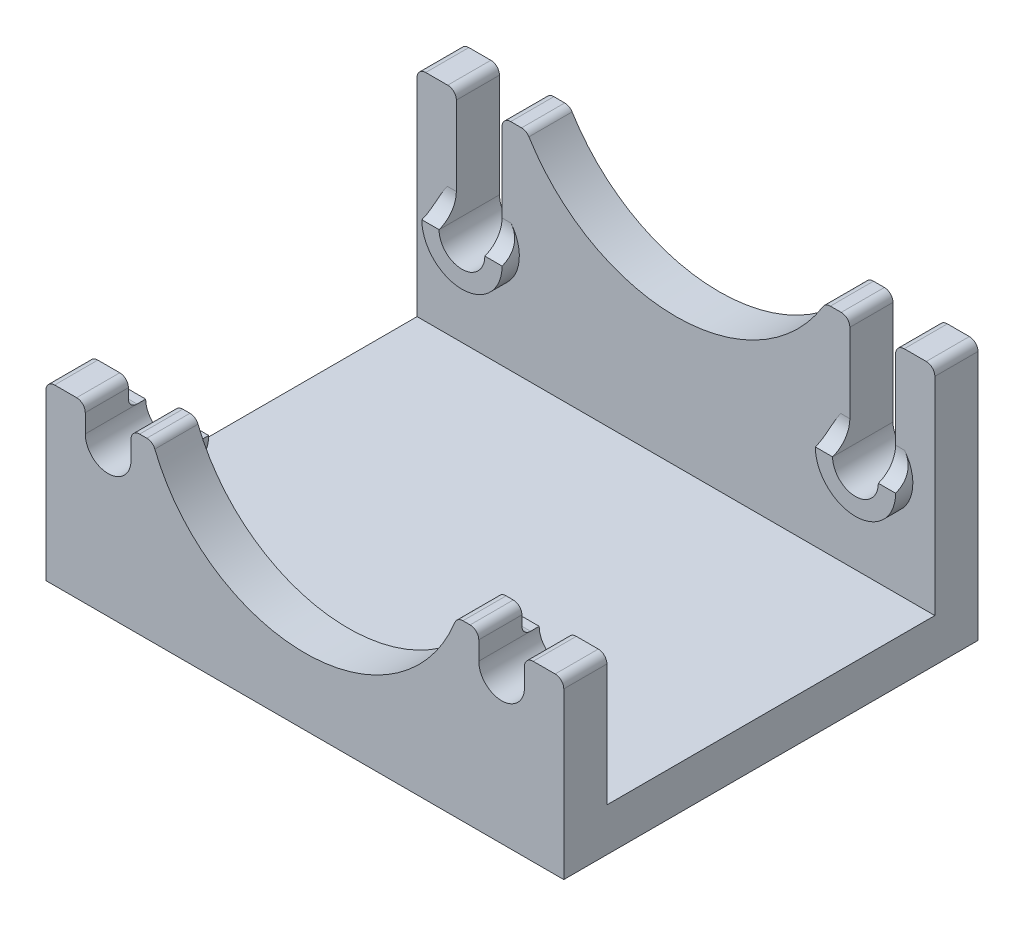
ISO-10303-21;
HEADER;
FILE_DESCRIPTION(('STEP AP214'),'2;1');
FILE_NAME('part.step','',(''),(''),'','','');
FILE_SCHEMA(('AUTOMOTIVE_DESIGN { 1 0 10303 214 1 1 1 1 }'));
ENDSEC;
DATA;
#1=APPLICATION_CONTEXT('core data for automotive mechanical design processes');
#2=APPLICATION_PROTOCOL_DEFINITION('international standard','automotive_design',2000,#1);
#3=PRODUCT_CONTEXT('',#1,'mechanical');
#4=PRODUCT('Part','Part','',(#3));
#5=PRODUCT_RELATED_PRODUCT_CATEGORY('part','',(#4));
#6=PRODUCT_DEFINITION_FORMATION('','',#4);
#7=PRODUCT_DEFINITION_CONTEXT('part definition',#1,'design');
#8=PRODUCT_DEFINITION('design','',#6,#7);
#9=PRODUCT_DEFINITION_SHAPE('','',#8);
#10=(LENGTH_UNIT() NAMED_UNIT(*) SI_UNIT(.MILLI.,.METRE.));
#11=(NAMED_UNIT(*) PLANE_ANGLE_UNIT() SI_UNIT($,.RADIAN.));
#12=(NAMED_UNIT(*) SI_UNIT($,.STERADIAN.) SOLID_ANGLE_UNIT());
#13=UNCERTAINTY_MEASURE_WITH_UNIT(LENGTH_MEASURE(1.E-05),#10,'distance_accuracy_value','');
#14=(GEOMETRIC_REPRESENTATION_CONTEXT(3) GLOBAL_UNCERTAINTY_ASSIGNED_CONTEXT((#13)) GLOBAL_UNIT_ASSIGNED_CONTEXT((#10,
#11,#12)) REPRESENTATION_CONTEXT('',''));
#15=CARTESIAN_POINT('',(0.,0.,0.));
#16=DIRECTION('',(0.,0.,1.));
#17=DIRECTION('',(1.,0.,0.));
#18=AXIS2_PLACEMENT_3D('',#15,#16,#17);
#19=CARTESIAN_POINT('',(-30.,32.4113100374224,19.));
#20=DIRECTION('',(0.,0.,1.));
#21=DIRECTION('',(0.,-1.,0.));
#22=AXIS2_PLACEMENT_3D('',#19,#20,#21);
#23=PLANE('',#22);
#24=DIRECTION('',(1.,0.,0.));
#25=VECTOR('',#24,1.);
#26=CARTESIAN_POINT('',(-30.,20.1384758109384,19.));
#27=LINE('',#26,#25);
#28=CARTESIAN_POINT('',(26.45,20.1384758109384,19.));
#29=VERTEX_POINT('',#28);
#30=CARTESIAN_POINT('',(29.,20.1384758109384,19.));
#31=VERTEX_POINT('',#30);
#32=EDGE_CURVE('E501',#29,#31,#27,.T.);
#33=ORIENTED_EDGE('',*,*,#32,.T.);
#34=CARTESIAN_POINT('',(29.,19.1384758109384,19.));
#35=DIRECTION('',(0.,0.,1.));
#36=DIRECTION('',(0.,-1.,0.));
#37=AXIS2_PLACEMENT_3D('',#34,#35,#36);
#38=CIRCLE('',#37,1.);
#39=CARTESIAN_POINT('',(30.,19.1384758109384,19.));
#40=VERTEX_POINT('',#39);
#41=EDGE_CURVE('E876',#31,#40,#38,.F.);
#42=ORIENTED_EDGE('',*,*,#41,.T.);
#43=DIRECTION('',(0.,-1.,0.));
#44=VECTOR('',#43,1.);
#45=CARTESIAN_POINT('',(30.,32.4113100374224,19.));
#46=LINE('',#45,#44);
#47=CARTESIAN_POINT('',(30.,5.,19.));
#48=VERTEX_POINT('',#47);
#49=EDGE_CURVE('E575',#40,#48,#46,.T.);
#50=ORIENTED_EDGE('',*,*,#49,.T.);
#51=DIRECTION('',(1.,0.,0.));
#52=VECTOR('',#51,1.);
#53=CARTESIAN_POINT('',(-30.,5.,19.));
#54=LINE('',#53,#52);
#55=CARTESIAN_POINT('',(-30.,5.,19.));
#56=VERTEX_POINT('',#55);
#57=EDGE_CURVE('E583',#56,#48,#54,.T.);
#58=ORIENTED_EDGE('',*,*,#57,.F.);
#59=DIRECTION('',(0.,-1.,0.));
#60=VECTOR('',#59,1.);
#61=CARTESIAN_POINT('',(-30.,0.,19.));
#62=LINE('',#61,#60);
#63=CARTESIAN_POINT('',(-30.,19.1384758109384,19.));
#64=VERTEX_POINT('',#63);
#65=EDGE_CURVE('E638',#64,#56,#62,.T.);
#66=ORIENTED_EDGE('',*,*,#65,.F.);
#67=CARTESIAN_POINT('',(-29.,19.1384758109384,19.));
#68=DIRECTION('',(0.,0.,1.));
#69=DIRECTION('',(0.,-1.,0.));
#70=AXIS2_PLACEMENT_3D('',#67,#68,#69);
#71=CIRCLE('',#70,1.);
#72=CARTESIAN_POINT('',(-29.,20.1384758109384,19.));
#73=VERTEX_POINT('',#72);
#74=EDGE_CURVE('E872',#64,#73,#71,.F.);
#75=ORIENTED_EDGE('',*,*,#74,.T.);
#76=DIRECTION('',(1.,0.,0.));
#77=VECTOR('',#76,1.);
#78=CARTESIAN_POINT('',(-30.,20.1384758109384,19.));
#79=LINE('',#78,#77);
#80=CARTESIAN_POINT('',(-26.45,20.1384758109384,19.));
#81=VERTEX_POINT('',#80);
#82=EDGE_CURVE('E506',#73,#81,#79,.T.);
#83=ORIENTED_EDGE('',*,*,#82,.T.);
#84=CARTESIAN_POINT('',(-26.45,19.1384758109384,19.));
#85=DIRECTION('',(0.,0.,1.));
#86=DIRECTION('',(0.,-1.,0.));
#87=AXIS2_PLACEMENT_3D('',#84,#85,#86);
#88=CIRCLE('',#87,1.);
#89=CARTESIAN_POINT('',(-25.45,19.1384758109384,19.));
#90=VERTEX_POINT('',#89);
#91=EDGE_CURVE('E48',#81,#90,#88,.F.);
#92=ORIENTED_EDGE('',*,*,#91,.T.);
#93=DIRECTION('',(0.,-1.,0.));
#94=VECTOR('',#93,1.);
#95=CARTESIAN_POINT('',(-25.45,32.4113100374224,19.));
#96=LINE('',#95,#94);
#97=CARTESIAN_POINT('',(-25.45,18.,19.));
#98=VERTEX_POINT('',#97);
#99=EDGE_CURVE('E567',#90,#98,#96,.T.);
#100=ORIENTED_EDGE('',*,*,#99,.T.);
#101=DIRECTION('',(-1.,0.,0.));
#102=VECTOR('',#101,1.);
#103=CARTESIAN_POINT('',(-30.,18.,19.));
#104=LINE('',#103,#102);
#105=CARTESIAN_POINT('',(-27.3412002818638,18.,19.));
#106=VERTEX_POINT('',#105);
#107=EDGE_CURVE('E1032',#98,#106,#104,.T.);
#108=ORIENTED_EDGE('',*,*,#107,.T.);
#109=CARTESIAN_POINT('',(-22.8,17.,19.));
#110=DIRECTION('',(0.,0.,1.));
#111=DIRECTION('',(1.,0.,0.));
#112=AXIS2_PLACEMENT_3D('',#109,#110,#111);
#113=CIRCLE('',#112,4.65);
#114=CARTESIAN_POINT('',(-18.2587997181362,18.,19.));
#115=VERTEX_POINT('',#114);
#116=EDGE_CURVE('E439',#106,#115,#113,.T.);
#117=ORIENTED_EDGE('',*,*,#116,.T.);
#118=DIRECTION('',(-1.,0.,0.));
#119=VECTOR('',#118,1.);
#120=CARTESIAN_POINT('',(-30.,18.,19.));
#121=LINE('',#120,#119);
#122=CARTESIAN_POINT('',(-20.15,18.,19.));
#123=VERTEX_POINT('',#122);
#124=EDGE_CURVE('E1025',#115,#123,#121,.T.);
#125=ORIENTED_EDGE('',*,*,#124,.T.);
#126=DIRECTION('',(0.,1.,0.));
#127=VECTOR('',#126,1.);
#128=CARTESIAN_POINT('',(-20.15,32.4113100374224,19.));
#129=LINE('',#128,#127);
#130=CARTESIAN_POINT('',(-20.15,19.1384758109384,19.));
#131=VERTEX_POINT('',#130);
#132=EDGE_CURVE('E572',#123,#131,#129,.T.);
#133=ORIENTED_EDGE('',*,*,#132,.T.);
#134=CARTESIAN_POINT('',(-19.15,19.1384758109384,19.));
#135=DIRECTION('',(0.,0.,1.));
#136=DIRECTION('',(0.,-1.,0.));
#137=AXIS2_PLACEMENT_3D('',#134,#135,#136);
#138=CIRCLE('',#137,1.);
#139=CARTESIAN_POINT('',(-19.15,20.1384758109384,19.));
#140=VERTEX_POINT('',#139);
#141=EDGE_CURVE('E863',#131,#140,#138,.F.);
#142=ORIENTED_EDGE('',*,*,#141,.T.);
#143=DIRECTION('',(1.,0.,0.));
#144=VECTOR('',#143,1.);
#145=CARTESIAN_POINT('',(-30.,20.1384758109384,19.));
#146=LINE('',#145,#144);
#147=CARTESIAN_POINT('',(-18.3165282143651,20.1384758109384,19.));
#148=VERTEX_POINT('',#147);
#149=EDGE_CURVE('E520',#140,#148,#146,.T.);
#150=ORIENTED_EDGE('',*,*,#149,.T.);
#151=CARTESIAN_POINT('',(-18.3165282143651,19.1384758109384,19.));
#152=DIRECTION('',(0.,0.,1.));
#153=DIRECTION('',(0.,-1.,0.));
#154=AXIS2_PLACEMENT_3D('',#151,#152,#153);
#155=CIRCLE('',#154,1.);
#156=CARTESIAN_POINT('',(-17.3879642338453,19.5096481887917,19.));
#157=VERTEX_POINT('',#156);
#158=EDGE_CURVE('E865',#148,#157,#155,.F.);
#159=ORIENTED_EDGE('',*,*,#158,.T.);
#160=CARTESIAN_POINT('',(0.,26.4600922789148,19.));
#161=DIRECTION('',(0.,0.,1.));
#162=DIRECTION('',(0.,-1.,0.));
#163=AXIS2_PLACEMENT_3D('',#160,#161,#162);
#164=CIRCLE('',#163,18.7256501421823);
#165=CARTESIAN_POINT('',(17.3879642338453,19.5096481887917,19.));
#166=VERTEX_POINT('',#165);
#167=EDGE_CURVE('E650',#157,#166,#164,.T.);
#168=ORIENTED_EDGE('',*,*,#167,.T.);
#169=CARTESIAN_POINT('',(18.3165282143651,19.1384758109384,19.));
#170=DIRECTION('',(0.,0.,1.));
#171=DIRECTION('',(0.,-1.,0.));
#172=AXIS2_PLACEMENT_3D('',#169,#170,#171);
#173=CIRCLE('',#172,1.);
#174=CARTESIAN_POINT('',(18.3165282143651,20.1384758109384,19.));
#175=VERTEX_POINT('',#174);
#176=EDGE_CURVE('E867',#166,#175,#173,.F.);
#177=ORIENTED_EDGE('',*,*,#176,.T.);
#178=DIRECTION('',(1.,0.,0.));
#179=VECTOR('',#178,1.);
#180=CARTESIAN_POINT('',(-30.,20.1384758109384,19.));
#181=LINE('',#180,#179);
#182=CARTESIAN_POINT('',(19.15,20.1384758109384,19.));
#183=VERTEX_POINT('',#182);
#184=EDGE_CURVE('E517',#175,#183,#181,.T.);
#185=ORIENTED_EDGE('',*,*,#184,.T.);
#186=CARTESIAN_POINT('',(19.15,19.1384758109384,19.));
#187=DIRECTION('',(0.,0.,1.));
#188=DIRECTION('',(0.,-1.,0.));
#189=AXIS2_PLACEMENT_3D('',#186,#187,#188);
#190=CIRCLE('',#189,1.);
#191=CARTESIAN_POINT('',(20.15,19.1384758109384,19.));
#192=VERTEX_POINT('',#191);
#193=EDGE_CURVE('E869',#183,#192,#190,.F.);
#194=ORIENTED_EDGE('',*,*,#193,.T.);
#195=DIRECTION('',(0.,1.,0.));
#196=VECTOR('',#195,1.);
#197=CARTESIAN_POINT('',(20.15,32.4113100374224,19.));
#198=LINE('',#197,#196);
#199=CARTESIAN_POINT('',(20.15,18.,19.));
#200=VERTEX_POINT('',#199);
#201=EDGE_CURVE('E541',#200,#192,#198,.T.);
#202=ORIENTED_EDGE('',*,*,#201,.F.);
#203=DIRECTION('',(1.,0.,0.));
#204=VECTOR('',#203,1.);
#205=CARTESIAN_POINT('',(18.15,18.,19.));
#206=LINE('',#205,#204);
#207=CARTESIAN_POINT('',(18.2587997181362,18.,19.));
#208=VERTEX_POINT('',#207);
#209=EDGE_CURVE('E942',#200,#208,#206,.F.);
#210=ORIENTED_EDGE('',*,*,#209,.T.);
#211=CARTESIAN_POINT('',(22.8,17.,19.));
#212=DIRECTION('',(0.,0.,-1.));
#213=DIRECTION('',(-1.,0.,0.));
#214=AXIS2_PLACEMENT_3D('',#211,#212,#213);
#215=CIRCLE('',#214,4.65);
#216=CARTESIAN_POINT('',(27.3412002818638,18.,19.));
#217=VERTEX_POINT('',#216);
#218=EDGE_CURVE('E433',#217,#208,#215,.T.);
#219=ORIENTED_EDGE('',*,*,#218,.F.);
#220=DIRECTION('',(1.,0.,0.));
#221=VECTOR('',#220,1.);
#222=CARTESIAN_POINT('',(25.45,18.,19.));
#223=LINE('',#222,#221);
#224=CARTESIAN_POINT('',(25.45,18.,19.));
#225=VERTEX_POINT('',#224);
#226=EDGE_CURVE('E1029',#217,#225,#223,.F.);
#227=ORIENTED_EDGE('',*,*,#226,.T.);
#228=DIRECTION('',(0.,-1.,0.));
#229=VECTOR('',#228,1.);
#230=CARTESIAN_POINT('',(25.45,32.4113100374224,19.));
#231=LINE('',#230,#229);
#232=CARTESIAN_POINT('',(25.45,19.1384758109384,19.));
#233=VERTEX_POINT('',#232);
#234=EDGE_CURVE('E546',#233,#225,#231,.T.);
#235=ORIENTED_EDGE('',*,*,#234,.F.);
#236=CARTESIAN_POINT('',(26.45,19.1384758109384,19.));
#237=DIRECTION('',(0.,0.,1.));
#238=DIRECTION('',(0.,-1.,0.));
#239=AXIS2_PLACEMENT_3D('',#236,#237,#238);
#240=CIRCLE('',#239,1.);
#241=EDGE_CURVE('E874',#233,#29,#240,.F.);
#242=ORIENTED_EDGE('',*,*,#241,.T.);
#243=EDGE_LOOP('',(#33,#42,#50,#58,#66,#75,#83,#92,#100,#108,#117,#125,#133,#142,#150,#159,#168,
#177,#185,#194,#202,#210,#219,#227,#235,#242));
#244=FACE_BOUND('',#243,.T.);
#245=ADVANCED_FACE('F33',(#244),#23,.F.);
#246=CARTESIAN_POINT('',(-30.,32.4113100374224,-19.));
#247=DIRECTION('',(0.,0.,-1.));
#248=DIRECTION('',(0.,1.,0.));
#249=AXIS2_PLACEMENT_3D('',#246,#247,#248);
#250=PLANE('',#249);
#251=DIRECTION('',(0.,1.,0.));
#252=VECTOR('',#251,1.);
#253=CARTESIAN_POINT('',(30.,32.4113100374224,-19.));
#254=LINE('',#253,#252);
#255=CARTESIAN_POINT('',(30.,5.,-19.));
#256=VERTEX_POINT('',#255);
#257=CARTESIAN_POINT('',(30.,29.,-19.));
#258=VERTEX_POINT('',#257);
#259=EDGE_CURVE('E580',#256,#258,#254,.T.);
#260=ORIENTED_EDGE('',*,*,#259,.T.);
#261=CARTESIAN_POINT('',(29.,29.,-19.));
#262=DIRECTION('',(0.,0.,-1.));
#263=DIRECTION('',(0.,1.,0.));
#264=AXIS2_PLACEMENT_3D('',#261,#262,#263);
#265=CIRCLE('',#264,1.);
#266=CARTESIAN_POINT('',(29.,30.,-19.));
#267=VERTEX_POINT('',#266);
#268=EDGE_CURVE('E784',#258,#267,#265,.F.);
#269=ORIENTED_EDGE('',*,*,#268,.T.);
#270=DIRECTION('',(1.,0.,0.));
#271=VECTOR('',#270,1.);
#272=CARTESIAN_POINT('',(17.3205080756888,30.,-19.));
#273=LINE('',#272,#271);
#274=CARTESIAN_POINT('',(26.45,30.,-19.));
#275=VERTEX_POINT('',#274);
#276=EDGE_CURVE('E601',#275,#267,#273,.T.);
#277=ORIENTED_EDGE('',*,*,#276,.F.);
#278=CARTESIAN_POINT('',(26.45,29.,-19.));
#279=DIRECTION('',(0.,0.,-1.));
#280=DIRECTION('',(0.,1.,0.));
#281=AXIS2_PLACEMENT_3D('',#278,#279,#280);
#282=CIRCLE('',#281,1.);
#283=CARTESIAN_POINT('',(25.45,29.,-19.));
#284=VERTEX_POINT('',#283);
#285=EDGE_CURVE('E803',#275,#284,#282,.F.);
#286=ORIENTED_EDGE('',*,*,#285,.T.);
#287=DIRECTION('',(0.,1.,0.));
#288=VECTOR('',#287,1.);
#289=CARTESIAN_POINT('',(25.45,32.4113100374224,-19.));
#290=LINE('',#289,#288);
#291=CARTESIAN_POINT('',(25.45,19.8284271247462,-19.));
#292=VERTEX_POINT('',#291);
#293=EDGE_CURVE('E647',#292,#284,#290,.T.);
#294=ORIENTED_EDGE('',*,*,#293,.F.);
#295=DIRECTION('',(1.,0.,0.));
#296=VECTOR('',#295,1.);
#297=CARTESIAN_POINT('',(-30.,19.8284271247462,-19.));
#298=LINE('',#297,#296);
#299=CARTESIAN_POINT('',(26.4908671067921,19.8284271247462,-19.));
#300=VERTEX_POINT('',#299);
#301=EDGE_CURVE('E1047',#292,#300,#298,.T.);
#302=ORIENTED_EDGE('',*,*,#301,.T.);
#303=CARTESIAN_POINT('',(22.8,17.,-19.));
#304=DIRECTION('',(0.,0.,-1.));
#305=DIRECTION('',(-1.,0.,0.));
#306=AXIS2_PLACEMENT_3D('',#303,#304,#305);
#307=CIRCLE('',#306,4.65);
#308=CARTESIAN_POINT('',(19.1091328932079,19.8284271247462,-19.));
#309=VERTEX_POINT('',#308);
#310=EDGE_CURVE('E470',#300,#309,#307,.T.);
#311=ORIENTED_EDGE('',*,*,#310,.T.);
#312=DIRECTION('',(1.,0.,0.));
#313=VECTOR('',#312,1.);
#314=CARTESIAN_POINT('',(-30.,19.8284271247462,-19.));
#315=LINE('',#314,#313);
#316=CARTESIAN_POINT('',(20.15,19.8284271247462,-19.));
#317=VERTEX_POINT('',#316);
#318=EDGE_CURVE('E1048',#309,#317,#315,.T.);
#319=ORIENTED_EDGE('',*,*,#318,.T.);
#320=DIRECTION('',(0.,-1.,0.));
#321=VECTOR('',#320,1.);
#322=CARTESIAN_POINT('',(20.15,32.4113100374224,-19.));
#323=LINE('',#322,#321);
#324=CARTESIAN_POINT('',(20.15,29.,-19.));
#325=VERTEX_POINT('',#324);
#326=EDGE_CURVE('E645',#325,#317,#323,.T.);
#327=ORIENTED_EDGE('',*,*,#326,.F.);
#328=CARTESIAN_POINT('',(19.15,29.,-19.));
#329=DIRECTION('',(0.,0.,-1.));
#330=DIRECTION('',(0.,1.,0.));
#331=AXIS2_PLACEMENT_3D('',#328,#329,#330);
#332=CIRCLE('',#331,1.);
#333=CARTESIAN_POINT('',(19.15,30.,-19.));
#334=VERTEX_POINT('',#333);
#335=EDGE_CURVE('E801',#325,#334,#332,.F.);
#336=ORIENTED_EDGE('',*,*,#335,.T.);
#337=CARTESIAN_POINT('',(17.8885438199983,30.,-19.));
#338=VERTEX_POINT('',#337);
#339=EDGE_CURVE('E602',#338,#334,#273,.T.);
#340=ORIENTED_EDGE('',*,*,#339,.F.);
#341=CARTESIAN_POINT('',(17.8885438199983,29.,-19.));
#342=DIRECTION('',(0.,0.,-1.));
#343=DIRECTION('',(0.,1.,0.));
#344=AXIS2_PLACEMENT_3D('',#341,#342,#343);
#345=CIRCLE('',#344,1.);
#346=CARTESIAN_POINT('',(17.0367083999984,29.5238095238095,-19.));
#347=VERTEX_POINT('',#346);
#348=EDGE_CURVE('E799',#338,#347,#345,.F.);
#349=ORIENTED_EDGE('',*,*,#348,.T.);
#350=CARTESIAN_POINT('',(0.,40.,-19.));
#351=DIRECTION('',(0.,0.,-1.));
#352=DIRECTION('',(0.,1.,0.));
#353=AXIS2_PLACEMENT_3D('',#350,#351,#352);
#354=CIRCLE('',#353,20.);
#355=CARTESIAN_POINT('',(-17.0367083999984,29.5238095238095,-19.));
#356=VERTEX_POINT('',#355);
#357=EDGE_CURVE('E598',#356,#347,#354,.F.);
#358=ORIENTED_EDGE('',*,*,#357,.F.);
#359=CARTESIAN_POINT('',(-17.8885438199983,29.,-19.));
#360=DIRECTION('',(0.,0.,-1.));
#361=DIRECTION('',(0.,1.,0.));
#362=AXIS2_PLACEMENT_3D('',#359,#360,#361);
#363=CIRCLE('',#362,1.);
#364=CARTESIAN_POINT('',(-17.8885438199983,30.,-19.));
#365=VERTEX_POINT('',#364);
#366=EDGE_CURVE('E797',#356,#365,#363,.F.);
#367=ORIENTED_EDGE('',*,*,#366,.T.);
#368=DIRECTION('',(1.,0.,0.));
#369=VECTOR('',#368,1.);
#370=CARTESIAN_POINT('',(-30.,30.,-19.));
#371=LINE('',#370,#369);
#372=CARTESIAN_POINT('',(-19.15,30.,-19.));
#373=VERTEX_POINT('',#372);
#374=EDGE_CURVE('E592',#373,#365,#371,.T.);
#375=ORIENTED_EDGE('',*,*,#374,.F.);
#376=CARTESIAN_POINT('',(-19.15,29.,-19.));
#377=DIRECTION('',(0.,0.,-1.));
#378=DIRECTION('',(0.,1.,0.));
#379=AXIS2_PLACEMENT_3D('',#376,#377,#378);
#380=CIRCLE('',#379,1.);
#381=CARTESIAN_POINT('',(-20.15,29.,-19.));
#382=VERTEX_POINT('',#381);
#383=EDGE_CURVE('E788',#373,#382,#380,.F.);
#384=ORIENTED_EDGE('',*,*,#383,.T.);
#385=DIRECTION('',(0.,-1.,0.));
#386=VECTOR('',#385,1.);
#387=CARTESIAN_POINT('',(-20.15,32.4113100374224,-19.));
#388=LINE('',#387,#386);
#389=CARTESIAN_POINT('',(-20.15,19.8284271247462,-19.));
#390=VERTEX_POINT('',#389);
#391=EDGE_CURVE('E643',#382,#390,#388,.T.);
#392=ORIENTED_EDGE('',*,*,#391,.T.);
#393=DIRECTION('',(-1.,0.,0.));
#394=VECTOR('',#393,1.);
#395=CARTESIAN_POINT('',(-30.,19.8284271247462,-19.));
#396=LINE('',#395,#394);
#397=CARTESIAN_POINT('',(-19.1091328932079,19.8284271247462,-19.));
#398=VERTEX_POINT('',#397);
#399=EDGE_CURVE('E655',#390,#398,#396,.F.);
#400=ORIENTED_EDGE('',*,*,#399,.T.);
#401=CARTESIAN_POINT('',(-22.8,17.,-19.));
#402=DIRECTION('',(0.,0.,1.));
#403=DIRECTION('',(1.,0.,0.));
#404=AXIS2_PLACEMENT_3D('',#401,#402,#403);
#405=CIRCLE('',#404,4.65);
#406=CARTESIAN_POINT('',(-26.4908671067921,19.8284271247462,-19.));
#407=VERTEX_POINT('',#406);
#408=EDGE_CURVE('E483',#407,#398,#405,.T.);
#409=ORIENTED_EDGE('',*,*,#408,.F.);
#410=DIRECTION('',(-1.,0.,0.));
#411=VECTOR('',#410,1.);
#412=CARTESIAN_POINT('',(-30.,19.8284271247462,-19.));
#413=LINE('',#412,#411);
#414=CARTESIAN_POINT('',(-25.45,19.8284271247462,-19.));
#415=VERTEX_POINT('',#414);
#416=EDGE_CURVE('E653',#407,#415,#413,.F.);
#417=ORIENTED_EDGE('',*,*,#416,.T.);
#418=DIRECTION('',(0.,1.,0.));
#419=VECTOR('',#418,1.);
#420=CARTESIAN_POINT('',(-25.45,32.4113100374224,-19.));
#421=LINE('',#420,#419);
#422=CARTESIAN_POINT('',(-25.45,29.,-19.));
#423=VERTEX_POINT('',#422);
#424=EDGE_CURVE('E640',#415,#423,#421,.T.);
#425=ORIENTED_EDGE('',*,*,#424,.T.);
#426=CARTESIAN_POINT('',(-26.45,29.,-19.));
#427=DIRECTION('',(0.,0.,-1.));
#428=DIRECTION('',(0.,1.,0.));
#429=AXIS2_PLACEMENT_3D('',#426,#427,#428);
#430=CIRCLE('',#429,1.);
#431=CARTESIAN_POINT('',(-26.45,30.,-19.));
#432=VERTEX_POINT('',#431);
#433=EDGE_CURVE('E785',#423,#432,#430,.F.);
#434=ORIENTED_EDGE('',*,*,#433,.T.);
#435=CARTESIAN_POINT('',(-29.,30.,-19.));
#436=VERTEX_POINT('',#435);
#437=EDGE_CURVE('E595',#436,#432,#371,.T.);
#438=ORIENTED_EDGE('',*,*,#437,.F.);
#439=CARTESIAN_POINT('',(-29.,29.,-19.));
#440=DIRECTION('',(0.,0.,-1.));
#441=DIRECTION('',(0.,1.,0.));
#442=AXIS2_PLACEMENT_3D('',#439,#440,#441);
#443=CIRCLE('',#442,1.);
#444=CARTESIAN_POINT('',(-30.,29.,-19.));
#445=VERTEX_POINT('',#444);
#446=EDGE_CURVE('E795',#436,#445,#443,.F.);
#447=ORIENTED_EDGE('',*,*,#446,.T.);
#448=DIRECTION('',(0.,1.,0.));
#449=VECTOR('',#448,1.);
#450=CARTESIAN_POINT('',(-30.,32.4113100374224,-19.));
#451=LINE('',#450,#449);
#452=CARTESIAN_POINT('',(-30.,5.,-19.));
#453=VERTEX_POINT('',#452);
#454=EDGE_CURVE('E579',#453,#445,#451,.T.);
#455=ORIENTED_EDGE('',*,*,#454,.F.);
#456=DIRECTION('',(1.,0.,0.));
#457=VECTOR('',#456,1.);
#458=CARTESIAN_POINT('',(-30.,5.,-19.));
#459=LINE('',#458,#457);
#460=EDGE_CURVE('E590',#453,#256,#459,.T.);
#461=ORIENTED_EDGE('',*,*,#460,.T.);
#462=EDGE_LOOP('',(#260,#269,#277,#286,#294,#302,#311,#319,#327,#336,#340,#349,#358,#367,#375,
#384,#392,#400,#409,#417,#425,#434,#438,#447,#455,#461));
#463=FACE_BOUND('',#462,.T.);
#464=ADVANCED_FACE('F731',(#463),#250,.F.);
#465=CARTESIAN_POINT('',(17.3205080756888,30.,24.));
#466=DIRECTION('',(0.,-1.,0.));
#467=DIRECTION('',(0.,0.,-1.));
#468=AXIS2_PLACEMENT_3D('',#465,#466,#467);
#469=PLANE('',#468);
#470=ORIENTED_EDGE('',*,*,#276,.T.);
#471=DIRECTION('',(0.,0.,-1.));
#472=VECTOR('',#471,1.);
#473=CARTESIAN_POINT('',(29.,30.,24.));
#474=LINE('',#473,#472);
#475=CARTESIAN_POINT('',(29.,30.,-24.));
#476=VERTEX_POINT('',#475);
#477=EDGE_CURVE('E1616',#267,#476,#474,.T.);
#478=ORIENTED_EDGE('',*,*,#477,.T.);
#479=DIRECTION('',(-1.,0.,0.));
#480=VECTOR('',#479,1.);
#481=CARTESIAN_POINT('',(17.3205080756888,30.,-24.));
#482=LINE('',#481,#480);
#483=CARTESIAN_POINT('',(26.45,30.,-24.));
#484=VERTEX_POINT('',#483);
#485=EDGE_CURVE('E624',#476,#484,#482,.T.);
#486=ORIENTED_EDGE('',*,*,#485,.T.);
#487=DIRECTION('',(0.,0.,-1.));
#488=VECTOR('',#487,1.);
#489=CARTESIAN_POINT('',(26.45,30.,-19.));
#490=LINE('',#489,#488);
#491=EDGE_CURVE('E1615',#484,#275,#490,.F.);
#492=ORIENTED_EDGE('',*,*,#491,.T.);
#493=EDGE_LOOP('',(#470,#478,#486,#492));
#494=FACE_BOUND('',#493,.T.);
#495=ADVANCED_FACE('F736',(#494),#469,.F.);
#496=ORIENTED_EDGE('',*,*,#339,.T.);
#497=DIRECTION('',(0.,0.,1.));
#498=VECTOR('',#497,1.);
#499=CARTESIAN_POINT('',(19.15,30.,-24.));
#500=LINE('',#499,#498);
#501=CARTESIAN_POINT('',(19.15,30.,-24.));
#502=VERTEX_POINT('',#501);
#503=EDGE_CURVE('E814',#334,#502,#500,.F.);
#504=ORIENTED_EDGE('',*,*,#503,.T.);
#505=CARTESIAN_POINT('',(17.8885438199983,30.,-24.));
#506=VERTEX_POINT('',#505);
#507=EDGE_CURVE('E621',#502,#506,#482,.T.);
#508=ORIENTED_EDGE('',*,*,#507,.T.);
#509=DIRECTION('',(0.,0.,-1.));
#510=VECTOR('',#509,1.);
#511=CARTESIAN_POINT('',(17.8885438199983,30.,24.));
#512=LINE('',#511,#510);
#513=EDGE_CURVE('E812',#506,#338,#512,.F.);
#514=ORIENTED_EDGE('',*,*,#513,.T.);
#515=EDGE_LOOP('',(#496,#504,#508,#514));
#516=FACE_BOUND('',#515,.T.);
#517=ADVANCED_FACE('F746',(#516),#469,.F.);
#518=CARTESIAN_POINT('',(0.,40.,24.));
#519=DIRECTION('',(0.,0.,1.));
#520=DIRECTION('',(1.,0.,0.));
#521=AXIS2_PLACEMENT_3D('',#518,#519,#520);
#522=PLANE('',#521);
#523=DIRECTION('',(0.,1.,0.));
#524=VECTOR('',#523,1.);
#525=CARTESIAN_POINT('',(30.,0.,24.));
#526=LINE('',#525,#524);
#527=CARTESIAN_POINT('',(30.,0.,24.));
#528=VERTEX_POINT('',#527);
#529=CARTESIAN_POINT('',(30.,19.1384758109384,24.));
#530=VERTEX_POINT('',#529);
#531=EDGE_CURVE('E609',#528,#530,#526,.T.);
#532=ORIENTED_EDGE('',*,*,#531,.T.);
#533=CARTESIAN_POINT('',(29.,19.1384758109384,24.));
#534=DIRECTION('',(0.,0.,1.));
#535=DIRECTION('',(1.,0.,0.));
#536=AXIS2_PLACEMENT_3D('',#533,#534,#535);
#537=CIRCLE('',#536,1.);
#538=CARTESIAN_POINT('',(29.,20.1384758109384,24.));
#539=VERTEX_POINT('',#538);
#540=EDGE_CURVE('E856',#530,#539,#537,.T.);
#541=ORIENTED_EDGE('',*,*,#540,.T.);
#542=DIRECTION('',(1.,0.,0.));
#543=VECTOR('',#542,1.);
#544=CARTESIAN_POINT('',(23.6214272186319,20.1384758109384,24.));
#545=LINE('',#544,#543);
#546=CARTESIAN_POINT('',(26.45,20.1384758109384,24.));
#547=VERTEX_POINT('',#546);
#548=EDGE_CURVE('E497',#547,#539,#545,.T.);
#549=ORIENTED_EDGE('',*,*,#548,.F.);
#550=CARTESIAN_POINT('',(26.45,19.1384758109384,24.));
#551=DIRECTION('',(0.,0.,1.));
#552=DIRECTION('',(1.,0.,0.));
#553=AXIS2_PLACEMENT_3D('',#550,#551,#552);
#554=CIRCLE('',#553,1.);
#555=CARTESIAN_POINT('',(25.45,19.1384758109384,24.));
#556=VERTEX_POINT('',#555);
#557=EDGE_CURVE('E854',#547,#556,#554,.T.);
#558=ORIENTED_EDGE('',*,*,#557,.T.);
#559=DIRECTION('',(0.,-1.,0.));
#560=VECTOR('',#559,1.);
#561=CARTESIAN_POINT('',(25.45,41.2809086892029,24.));
#562=LINE('',#561,#560);
#563=CARTESIAN_POINT('',(25.45,17.,24.));
#564=VERTEX_POINT('',#563);
#565=EDGE_CURVE('E528',#556,#564,#562,.T.);
#566=ORIENTED_EDGE('',*,*,#565,.T.);
#567=CARTESIAN_POINT('',(22.8,17.,24.));
#568=DIRECTION('',(0.,0.,-1.));
#569=DIRECTION('',(-1.,0.,0.));
#570=AXIS2_PLACEMENT_3D('',#567,#568,#569);
#571=CIRCLE('',#570,2.65);
#572=CARTESIAN_POINT('',(20.15,17.,24.));
#573=VERTEX_POINT('',#572);
#574=EDGE_CURVE('E535',#564,#573,#571,.T.);
#575=ORIENTED_EDGE('',*,*,#574,.T.);
#576=DIRECTION('',(0.,1.,0.));
#577=VECTOR('',#576,1.);
#578=CARTESIAN_POINT('',(20.15,41.2809086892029,24.));
#579=LINE('',#578,#577);
#580=CARTESIAN_POINT('',(20.15,19.1384758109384,24.));
#581=VERTEX_POINT('',#580);
#582=EDGE_CURVE('E523',#573,#581,#579,.T.);
#583=ORIENTED_EDGE('',*,*,#582,.T.);
#584=CARTESIAN_POINT('',(19.15,19.1384758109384,24.));
#585=DIRECTION('',(0.,0.,1.));
#586=DIRECTION('',(1.,0.,0.));
#587=AXIS2_PLACEMENT_3D('',#584,#585,#586);
#588=CIRCLE('',#587,1.);
#589=CARTESIAN_POINT('',(19.15,20.1384758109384,24.));
#590=VERTEX_POINT('',#589);
#591=EDGE_CURVE('E848',#581,#590,#588,.T.);
#592=ORIENTED_EDGE('',*,*,#591,.T.);
#593=DIRECTION('',(1.,0.,0.));
#594=VECTOR('',#593,1.);
#595=CARTESIAN_POINT('',(17.6263194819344,20.1384758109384,24.));
#596=LINE('',#595,#594);
#597=CARTESIAN_POINT('',(18.3165282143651,20.1384758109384,24.));
#598=VERTEX_POINT('',#597);
#599=EDGE_CURVE('E514',#598,#590,#596,.T.);
#600=ORIENTED_EDGE('',*,*,#599,.F.);
#601=CARTESIAN_POINT('',(18.3165282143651,19.1384758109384,24.));
#602=DIRECTION('',(0.,0.,1.));
#603=DIRECTION('',(1.,0.,0.));
#604=AXIS2_PLACEMENT_3D('',#601,#602,#603);
#605=CIRCLE('',#604,1.);
#606=CARTESIAN_POINT('',(17.3879642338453,19.5096481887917,24.));
#607=VERTEX_POINT('',#606);
#608=EDGE_CURVE('E846',#598,#607,#605,.T.);
#609=ORIENTED_EDGE('',*,*,#608,.T.);
#610=CARTESIAN_POINT('',(0.,26.4600922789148,24.));
#611=DIRECTION('',(0.,0.,1.));
#612=DIRECTION('',(1.,0.,0.));
#613=AXIS2_PLACEMENT_3D('',#610,#611,#612);
#614=CIRCLE('',#613,18.7256501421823);
#615=CARTESIAN_POINT('',(-17.3879642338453,19.5096481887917,24.));
#616=VERTEX_POINT('',#615);
#617=EDGE_CURVE('E511',#616,#607,#614,.T.);
#618=ORIENTED_EDGE('',*,*,#617,.F.);
#619=CARTESIAN_POINT('',(-18.3165282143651,19.1384758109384,24.));
#620=DIRECTION('',(0.,0.,1.));
#621=DIRECTION('',(1.,0.,0.));
#622=AXIS2_PLACEMENT_3D('',#619,#620,#621);
#623=CIRCLE('',#622,1.);
#624=CARTESIAN_POINT('',(-18.3165282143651,20.1384758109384,24.));
#625=VERTEX_POINT('',#624);
#626=EDGE_CURVE('E844',#616,#625,#623,.T.);
#627=ORIENTED_EDGE('',*,*,#626,.T.);
#628=DIRECTION('',(1.,0.,0.));
#629=VECTOR('',#628,1.);
#630=CARTESIAN_POINT('',(-21.5230770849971,20.1384758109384,24.));
#631=LINE('',#630,#629);
#632=CARTESIAN_POINT('',(-19.15,20.1384758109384,24.));
#633=VERTEX_POINT('',#632);
#634=EDGE_CURVE('E508',#633,#625,#631,.T.);
#635=ORIENTED_EDGE('',*,*,#634,.F.);
#636=CARTESIAN_POINT('',(-19.15,19.1384758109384,24.));
#637=DIRECTION('',(0.,0.,1.));
#638=DIRECTION('',(1.,0.,0.));
#639=AXIS2_PLACEMENT_3D('',#636,#637,#638);
#640=CIRCLE('',#639,1.);
#641=CARTESIAN_POINT('',(-20.15,19.1384758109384,24.));
#642=VERTEX_POINT('',#641);
#643=EDGE_CURVE('E842',#633,#642,#640,.T.);
#644=ORIENTED_EDGE('',*,*,#643,.T.);
#645=DIRECTION('',(0.,1.,0.));
#646=VECTOR('',#645,1.);
#647=CARTESIAN_POINT('',(-20.15,41.2809086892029,24.));
#648=LINE('',#647,#646);
#649=CARTESIAN_POINT('',(-20.15,17.,24.));
#650=VERTEX_POINT('',#649);
#651=EDGE_CURVE('E552',#650,#642,#648,.T.);
#652=ORIENTED_EDGE('',*,*,#651,.F.);
#653=CARTESIAN_POINT('',(-22.8,17.,24.));
#654=DIRECTION('',(0.,0.,1.));
#655=DIRECTION('',(1.,0.,0.));
#656=AXIS2_PLACEMENT_3D('',#653,#654,#655);
#657=CIRCLE('',#656,2.65);
#658=CARTESIAN_POINT('',(-25.45,17.,24.));
#659=VERTEX_POINT('',#658);
#660=EDGE_CURVE('E560',#659,#650,#657,.T.);
#661=ORIENTED_EDGE('',*,*,#660,.F.);
#662=DIRECTION('',(0.,-1.,0.));
#663=VECTOR('',#662,1.);
#664=CARTESIAN_POINT('',(-25.45,41.2809086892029,24.));
#665=LINE('',#664,#663);
#666=CARTESIAN_POINT('',(-25.45,19.1384758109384,24.));
#667=VERTEX_POINT('',#666);
#668=EDGE_CURVE('E548',#667,#659,#665,.T.);
#669=ORIENTED_EDGE('',*,*,#668,.F.);
#670=CARTESIAN_POINT('',(-26.45,19.1384758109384,24.));
#671=DIRECTION('',(0.,0.,1.));
#672=DIRECTION('',(1.,0.,0.));
#673=AXIS2_PLACEMENT_3D('',#670,#671,#672);
#674=CIRCLE('',#673,1.);
#675=CARTESIAN_POINT('',(-26.45,20.1384758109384,24.));
#676=VERTEX_POINT('',#675);
#677=EDGE_CURVE('E850',#667,#676,#674,.T.);
#678=ORIENTED_EDGE('',*,*,#677,.T.);
#679=DIRECTION('',(1.,0.,0.));
#680=VECTOR('',#679,1.);
#681=CARTESIAN_POINT('',(-24.2209558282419,20.1384758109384,24.));
#682=LINE('',#681,#680);
#683=CARTESIAN_POINT('',(-29.,20.1384758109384,24.));
#684=VERTEX_POINT('',#683);
#685=EDGE_CURVE('E504',#684,#676,#682,.T.);
#686=ORIENTED_EDGE('',*,*,#685,.F.);
#687=CARTESIAN_POINT('',(-29.,19.1384758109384,24.));
#688=DIRECTION('',(0.,0.,1.));
#689=DIRECTION('',(1.,0.,0.));
#690=AXIS2_PLACEMENT_3D('',#687,#688,#689);
#691=CIRCLE('',#690,1.);
#692=CARTESIAN_POINT('',(-30.,19.1384758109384,24.));
#693=VERTEX_POINT('',#692);
#694=EDGE_CURVE('E852',#684,#693,#691,.T.);
#695=ORIENTED_EDGE('',*,*,#694,.T.);
#696=DIRECTION('',(0.,-1.,0.));
#697=VECTOR('',#696,1.);
#698=CARTESIAN_POINT('',(-30.,0.,24.));
#699=LINE('',#698,#697);
#700=CARTESIAN_POINT('',(-30.,0.,24.));
#701=VERTEX_POINT('',#700);
#702=EDGE_CURVE('E613',#693,#701,#699,.T.);
#703=ORIENTED_EDGE('',*,*,#702,.T.);
#704=DIRECTION('',(1.,0.,0.));
#705=VECTOR('',#704,1.);
#706=CARTESIAN_POINT('',(-30.,0.,24.));
#707=LINE('',#706,#705);
#708=EDGE_CURVE('E606',#701,#528,#707,.T.);
#709=ORIENTED_EDGE('',*,*,#708,.T.);
#710=EDGE_LOOP('',(#532,#541,#549,#558,#566,#575,#583,#592,#600,#609,#618,#627,#635,#644,#652,
#661,#669,#678,#686,#695,#703,#709));
#711=FACE_BOUND('',#710,.T.);
#712=ADVANCED_FACE('F742',(#711),#522,.T.);
#713=CARTESIAN_POINT('',(0.,40.,-24.));
#714=DIRECTION('',(0.,0.,1.));
#715=DIRECTION('',(1.,0.,0.));
#716=AXIS2_PLACEMENT_3D('',#713,#714,#715);
#717=PLANE('',#716);
#718=ORIENTED_EDGE('',*,*,#485,.F.);
#719=CARTESIAN_POINT('',(29.,29.,-24.));
#720=DIRECTION('',(0.,0.,1.));
#721=DIRECTION('',(1.,0.,0.));
#722=AXIS2_PLACEMENT_3D('',#719,#720,#721);
#723=CIRCLE('',#722,1.);
#724=CARTESIAN_POINT('',(30.,29.,-24.));
#725=VERTEX_POINT('',#724);
#726=EDGE_CURVE('E782',#476,#725,#723,.F.);
#727=ORIENTED_EDGE('',*,*,#726,.T.);
#728=DIRECTION('',(0.,1.,0.));
#729=VECTOR('',#728,1.);
#730=CARTESIAN_POINT('',(30.,0.,-24.));
#731=LINE('',#730,#729);
#732=CARTESIAN_POINT('',(30.,0.,-24.));
#733=VERTEX_POINT('',#732);
#734=EDGE_CURVE('E618',#733,#725,#731,.T.);
#735=ORIENTED_EDGE('',*,*,#734,.F.);
#736=DIRECTION('',(1.,0.,0.));
#737=VECTOR('',#736,1.);
#738=CARTESIAN_POINT('',(-30.,0.,-24.));
#739=LINE('',#738,#737);
#740=CARTESIAN_POINT('',(-30.,0.,-24.));
#741=VERTEX_POINT('',#740);
#742=EDGE_CURVE('E605',#741,#733,#739,.T.);
#743=ORIENTED_EDGE('',*,*,#742,.F.);
#744=DIRECTION('',(0.,-1.,0.));
#745=VECTOR('',#744,1.);
#746=CARTESIAN_POINT('',(-30.,0.,-24.));
#747=LINE('',#746,#745);
#748=CARTESIAN_POINT('',(-30.,29.,-24.));
#749=VERTEX_POINT('',#748);
#750=EDGE_CURVE('E610',#749,#741,#747,.T.);
#751=ORIENTED_EDGE('',*,*,#750,.F.);
#752=CARTESIAN_POINT('',(-29.,29.,-24.));
#753=DIRECTION('',(0.,0.,1.));
#754=DIRECTION('',(1.,0.,0.));
#755=AXIS2_PLACEMENT_3D('',#752,#753,#754);
#756=CIRCLE('',#755,1.);
#757=CARTESIAN_POINT('',(-29.,30.,-24.));
#758=VERTEX_POINT('',#757);
#759=EDGE_CURVE('E1077',#749,#758,#756,.F.);
#760=ORIENTED_EDGE('',*,*,#759,.T.);
#761=DIRECTION('',(-1.,0.,0.));
#762=VECTOR('',#761,1.);
#763=CARTESIAN_POINT('',(-30.,30.,-24.));
#764=LINE('',#763,#762);
#765=CARTESIAN_POINT('',(-26.45,30.,-24.));
#766=VERTEX_POINT('',#765);
#767=EDGE_CURVE('E628',#766,#758,#764,.T.);
#768=ORIENTED_EDGE('',*,*,#767,.F.);
#769=CARTESIAN_POINT('',(-26.45,29.,-24.));
#770=DIRECTION('',(0.,0.,1.));
#771=DIRECTION('',(1.,0.,0.));
#772=AXIS2_PLACEMENT_3D('',#769,#770,#771);
#773=CIRCLE('',#772,1.);
#774=CARTESIAN_POINT('',(-25.45,29.,-24.));
#775=VERTEX_POINT('',#774);
#776=EDGE_CURVE('E1068',#766,#775,#773,.F.);
#777=ORIENTED_EDGE('',*,*,#776,.T.);
#778=DIRECTION('',(0.,-1.,0.));
#779=VECTOR('',#778,1.);
#780=CARTESIAN_POINT('',(-25.45,41.2809086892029,-24.));
#781=LINE('',#780,#779);
#782=CARTESIAN_POINT('',(-25.45,17.,-24.));
#783=VERTEX_POINT('',#782);
#784=EDGE_CURVE('E549',#775,#783,#781,.T.);
#785=ORIENTED_EDGE('',*,*,#784,.T.);
#786=CARTESIAN_POINT('',(-22.8,17.,-24.));
#787=DIRECTION('',(0.,0.,1.));
#788=DIRECTION('',(1.,0.,0.));
#789=AXIS2_PLACEMENT_3D('',#786,#787,#788);
#790=CIRCLE('',#789,2.65);
#791=CARTESIAN_POINT('',(-20.15,17.,-24.));
#792=VERTEX_POINT('',#791);
#793=EDGE_CURVE('E551',#783,#792,#790,.T.);
#794=ORIENTED_EDGE('',*,*,#793,.T.);
#795=DIRECTION('',(0.,1.,0.));
#796=VECTOR('',#795,1.);
#797=CARTESIAN_POINT('',(-20.15,41.2809086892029,-24.));
#798=LINE('',#797,#796);
#799=CARTESIAN_POINT('',(-20.15,29.,-24.));
#800=VERTEX_POINT('',#799);
#801=EDGE_CURVE('E555',#792,#800,#798,.T.);
#802=ORIENTED_EDGE('',*,*,#801,.T.);
#803=CARTESIAN_POINT('',(-19.15,29.,-24.));
#804=DIRECTION('',(0.,0.,1.));
#805=DIRECTION('',(1.,0.,0.));
#806=AXIS2_PLACEMENT_3D('',#803,#804,#805);
#807=CIRCLE('',#806,1.);
#808=CARTESIAN_POINT('',(-19.15,30.,-24.));
#809=VERTEX_POINT('',#808);
#810=EDGE_CURVE('E1622',#800,#809,#807,.F.);
#811=ORIENTED_EDGE('',*,*,#810,.T.);
#812=CARTESIAN_POINT('',(-17.8885438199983,30.,-24.));
#813=VERTEX_POINT('',#812);
#814=EDGE_CURVE('E629',#813,#809,#764,.T.);
#815=ORIENTED_EDGE('',*,*,#814,.F.);
#816=CARTESIAN_POINT('',(-17.8885438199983,29.,-24.));
#817=DIRECTION('',(0.,0.,1.));
#818=DIRECTION('',(1.,0.,0.));
#819=AXIS2_PLACEMENT_3D('',#816,#817,#818);
#820=CIRCLE('',#819,1.);
#821=CARTESIAN_POINT('',(-17.0367083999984,29.5238095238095,-24.));
#822=VERTEX_POINT('',#821);
#823=EDGE_CURVE('E1625',#813,#822,#820,.F.);
#824=ORIENTED_EDGE('',*,*,#823,.T.);
#825=CARTESIAN_POINT('',(0.,40.,-24.));
#826=DIRECTION('',(0.,0.,-1.));
#827=DIRECTION('',(1.,0.,0.));
#828=AXIS2_PLACEMENT_3D('',#825,#826,#827);
#829=CIRCLE('',#828,20.);
#830=CARTESIAN_POINT('',(17.0367083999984,29.5238095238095,-24.));
#831=VERTEX_POINT('',#830);
#832=EDGE_CURVE('E625',#831,#822,#829,.T.);
#833=ORIENTED_EDGE('',*,*,#832,.F.);
#834=CARTESIAN_POINT('',(17.8885438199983,29.,-24.));
#835=DIRECTION('',(0.,0.,1.));
#836=DIRECTION('',(1.,0.,0.));
#837=AXIS2_PLACEMENT_3D('',#834,#835,#836);
#838=CIRCLE('',#837,1.);
#839=EDGE_CURVE('E1627',#831,#506,#838,.F.);
#840=ORIENTED_EDGE('',*,*,#839,.T.);
#841=ORIENTED_EDGE('',*,*,#507,.F.);
#842=CARTESIAN_POINT('',(19.15,29.,-24.));
#843=DIRECTION('',(0.,0.,1.));
#844=DIRECTION('',(1.,0.,0.));
#845=AXIS2_PLACEMENT_3D('',#842,#843,#844);
#846=CIRCLE('',#845,1.);
#847=CARTESIAN_POINT('',(20.15,29.,-24.));
#848=VERTEX_POINT('',#847);
#849=EDGE_CURVE('E1629',#502,#848,#846,.F.);
#850=ORIENTED_EDGE('',*,*,#849,.T.);
#851=DIRECTION('',(0.,1.,0.));
#852=VECTOR('',#851,1.);
#853=CARTESIAN_POINT('',(20.15,41.2809086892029,-24.));
#854=LINE('',#853,#852);
#855=CARTESIAN_POINT('',(20.15,17.,-24.));
#856=VERTEX_POINT('',#855);
#857=EDGE_CURVE('E524',#856,#848,#854,.T.);
#858=ORIENTED_EDGE('',*,*,#857,.F.);
#859=CARTESIAN_POINT('',(22.8,17.,-24.));
#860=DIRECTION('',(0.,0.,-1.));
#861=DIRECTION('',(-1.,0.,0.));
#862=AXIS2_PLACEMENT_3D('',#859,#860,#861);
#863=CIRCLE('',#862,2.65);
#864=CARTESIAN_POINT('',(25.45,17.,-24.));
#865=VERTEX_POINT('',#864);
#866=EDGE_CURVE('E527',#865,#856,#863,.T.);
#867=ORIENTED_EDGE('',*,*,#866,.F.);
#868=DIRECTION('',(0.,-1.,0.));
#869=VECTOR('',#868,1.);
#870=CARTESIAN_POINT('',(25.45,41.2809086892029,-24.));
#871=LINE('',#870,#869);
#872=CARTESIAN_POINT('',(25.45,29.,-24.));
#873=VERTEX_POINT('',#872);
#874=EDGE_CURVE('E530',#873,#865,#871,.T.);
#875=ORIENTED_EDGE('',*,*,#874,.F.);
#876=CARTESIAN_POINT('',(26.45,29.,-24.));
#877=DIRECTION('',(0.,0.,1.));
#878=DIRECTION('',(1.,0.,0.));
#879=AXIS2_PLACEMENT_3D('',#876,#877,#878);
#880=CIRCLE('',#879,1.);
#881=EDGE_CURVE('E1631',#873,#484,#880,.F.);
#882=ORIENTED_EDGE('',*,*,#881,.T.);
#883=EDGE_LOOP('',(#718,#727,#735,#743,#751,#760,#768,#777,#785,#794,#802,#811,#815,#824,#833,
#840,#841,#850,#858,#867,#875,#882));
#884=FACE_BOUND('',#883,.T.);
#885=ADVANCED_FACE('F745',(#884),#717,.F.);
#886=CARTESIAN_POINT('',(-30.,30.,24.));
#887=DIRECTION('',(0.,-1.,0.));
#888=DIRECTION('',(0.,0.,-1.));
#889=AXIS2_PLACEMENT_3D('',#886,#887,#888);
#890=PLANE('',#889);
#891=ORIENTED_EDGE('',*,*,#374,.T.);
#892=DIRECTION('',(0.,0.,-1.));
#893=VECTOR('',#892,1.);
#894=CARTESIAN_POINT('',(-17.8885438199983,30.,24.));
#895=LINE('',#894,#893);
#896=EDGE_CURVE('E824',#365,#813,#895,.T.);
#897=ORIENTED_EDGE('',*,*,#896,.T.);
#898=ORIENTED_EDGE('',*,*,#814,.T.);
#899=DIRECTION('',(0.,0.,1.));
#900=VECTOR('',#899,1.);
#901=CARTESIAN_POINT('',(-19.15,30.,24.));
#902=LINE('',#901,#900);
#903=EDGE_CURVE('E821',#809,#373,#902,.T.);
#904=ORIENTED_EDGE('',*,*,#903,.T.);
#905=EDGE_LOOP('',(#891,#897,#898,#904));
#906=FACE_BOUND('',#905,.T.);
#907=ADVANCED_FACE('F750',(#906),#890,.F.);
#908=CARTESIAN_POINT('',(-30.,0.,24.));
#909=DIRECTION('',(0.,1.,0.));
#910=DIRECTION('',(0.,0.,1.));
#911=AXIS2_PLACEMENT_3D('',#908,#909,#910);
#912=PLANE('',#911);
#913=ORIENTED_EDGE('',*,*,#742,.T.);
#914=DIRECTION('',(0.,0.,-1.));
#915=VECTOR('',#914,1.);
#916=CARTESIAN_POINT('',(30.,0.,24.));
#917=LINE('',#916,#915);
#918=EDGE_CURVE('E635',#528,#733,#917,.T.);
#919=ORIENTED_EDGE('',*,*,#918,.F.);
#920=ORIENTED_EDGE('',*,*,#708,.F.);
#921=DIRECTION('',(0.,0.,-1.));
#922=VECTOR('',#921,1.);
#923=CARTESIAN_POINT('',(-30.,0.,24.));
#924=LINE('',#923,#922);
#925=EDGE_CURVE('E615',#701,#741,#924,.T.);
#926=ORIENTED_EDGE('',*,*,#925,.T.);
#927=EDGE_LOOP('',(#913,#919,#920,#926));
#928=FACE_BOUND('',#927,.T.);
#929=ADVANCED_FACE('F685',(#928),#912,.F.);
#930=CARTESIAN_POINT('',(30.,0.,24.));
#931=DIRECTION('',(-1.,0.,0.));
#932=DIRECTION('',(0.,0.,1.));
#933=AXIS2_PLACEMENT_3D('',#930,#931,#932);
#934=PLANE('',#933);
#935=ORIENTED_EDGE('',*,*,#734,.T.);
#936=DIRECTION('',(0.,0.,-1.));
#937=VECTOR('',#936,1.);
#938=CARTESIAN_POINT('',(30.,29.,24.));
#939=LINE('',#938,#937);
#940=EDGE_CURVE('E775',#725,#258,#939,.F.);
#941=ORIENTED_EDGE('',*,*,#940,.T.);
#942=ORIENTED_EDGE('',*,*,#259,.F.);
#943=DIRECTION('',(0.,0.,-1.));
#944=VECTOR('',#943,1.);
#945=CARTESIAN_POINT('',(30.,5.,19.));
#946=LINE('',#945,#944);
#947=EDGE_CURVE('E585',#48,#256,#946,.T.);
#948=ORIENTED_EDGE('',*,*,#947,.F.);
#949=ORIENTED_EDGE('',*,*,#49,.F.);
#950=DIRECTION('',(0.,0.,1.));
#951=VECTOR('',#950,1.);
#952=CARTESIAN_POINT('',(30.,19.1384758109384,24.));
#953=LINE('',#952,#951);
#954=EDGE_CURVE('E786',#40,#530,#953,.T.);
#955=ORIENTED_EDGE('',*,*,#954,.T.);
#956=ORIENTED_EDGE('',*,*,#531,.F.);
#957=ORIENTED_EDGE('',*,*,#918,.T.);
#958=EDGE_LOOP('',(#935,#941,#942,#948,#949,#955,#956,#957));
#959=FACE_BOUND('',#958,.T.);
#960=ADVANCED_FACE('F763',(#959),#934,.F.);
#961=CARTESIAN_POINT('',(0.,40.,24.));
#962=DIRECTION('',(0.,0.,-1.));
#963=DIRECTION('',(-1.,0.,0.));
#964=AXIS2_PLACEMENT_3D('',#961,#962,#963);
#965=CYLINDRICAL_SURFACE('',#964,20.);
#966=ORIENTED_EDGE('',*,*,#357,.T.);
#967=DIRECTION('',(0.,0.,-1.));
#968=VECTOR('',#967,1.);
#969=CARTESIAN_POINT('',(17.0367083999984,29.5238095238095,24.));
#970=LINE('',#969,#968);
#971=EDGE_CURVE('E818',#347,#831,#970,.T.);
#972=ORIENTED_EDGE('',*,*,#971,.T.);
#973=ORIENTED_EDGE('',*,*,#832,.T.);
#974=DIRECTION('',(0.,0.,-1.));
#975=VECTOR('',#974,1.);
#976=CARTESIAN_POINT('',(-17.0367083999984,29.5238095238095,24.));
#977=LINE('',#976,#975);
#978=EDGE_CURVE('E816',#822,#356,#977,.F.);
#979=ORIENTED_EDGE('',*,*,#978,.T.);
#980=EDGE_LOOP('',(#966,#972,#973,#979));
#981=FACE_BOUND('',#980,.T.);
#982=ADVANCED_FACE('F759',(#981),#965,.F.);
#983=ORIENTED_EDGE('',*,*,#767,.T.);
#984=DIRECTION('',(0.,0.,-1.));
#985=VECTOR('',#984,1.);
#986=CARTESIAN_POINT('',(-29.,30.,24.));
#987=LINE('',#986,#985);
#988=EDGE_CURVE('E836',#758,#436,#987,.F.);
#989=ORIENTED_EDGE('',*,*,#988,.T.);
#990=ORIENTED_EDGE('',*,*,#437,.T.);
#991=DIRECTION('',(0.,0.,-1.));
#992=VECTOR('',#991,1.);
#993=CARTESIAN_POINT('',(-26.45,30.,24.));
#994=LINE('',#993,#992);
#995=EDGE_CURVE('E833',#432,#766,#994,.T.);
#996=ORIENTED_EDGE('',*,*,#995,.T.);
#997=EDGE_LOOP('',(#983,#989,#990,#996));
#998=FACE_BOUND('',#997,.T.);
#999=ADVANCED_FACE('F755',(#998),#890,.F.);
#1000=CARTESIAN_POINT('',(-30.,0.,24.));
#1001=DIRECTION('',(1.,0.,0.));
#1002=DIRECTION('',(0.,0.,-1.));
#1003=AXIS2_PLACEMENT_3D('',#1000,#1001,#1002);
#1004=PLANE('',#1003);
#1005=ORIENTED_EDGE('',*,*,#454,.T.);
#1006=DIRECTION('',(0.,0.,-1.));
#1007=VECTOR('',#1006,1.);
#1008=CARTESIAN_POINT('',(-30.,29.,24.));
#1009=LINE('',#1008,#1007);
#1010=EDGE_CURVE('E830',#445,#749,#1009,.T.);
#1011=ORIENTED_EDGE('',*,*,#1010,.T.);
#1012=ORIENTED_EDGE('',*,*,#750,.T.);
#1013=ORIENTED_EDGE('',*,*,#925,.F.);
#1014=ORIENTED_EDGE('',*,*,#702,.F.);
#1015=DIRECTION('',(0.,0.,-1.));
#1016=VECTOR('',#1015,1.);
#1017=CARTESIAN_POINT('',(-30.,19.1384758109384,24.));
#1018=LINE('',#1017,#1016);
#1019=EDGE_CURVE('E827',#693,#64,#1018,.T.);
#1020=ORIENTED_EDGE('',*,*,#1019,.T.);
#1021=ORIENTED_EDGE('',*,*,#65,.T.);
#1022=DIRECTION('',(0.,0.,-1.));
#1023=VECTOR('',#1022,1.);
#1024=CARTESIAN_POINT('',(-30.,5.,19.));
#1025=LINE('',#1024,#1023);
#1026=EDGE_CURVE('E576',#56,#453,#1025,.T.);
#1027=ORIENTED_EDGE('',*,*,#1026,.T.);
#1028=EDGE_LOOP('',(#1005,#1011,#1012,#1013,#1014,#1020,#1021,#1027));
#1029=FACE_BOUND('',#1028,.T.);
#1030=ADVANCED_FACE('F752',(#1029),#1004,.F.);
#1031=CARTESIAN_POINT('',(-30.,5.,19.));
#1032=DIRECTION('',(0.,-1.,0.));
#1033=DIRECTION('',(0.,0.,-1.));
#1034=AXIS2_PLACEMENT_3D('',#1031,#1032,#1033);
#1035=PLANE('',#1034);
#1036=ORIENTED_EDGE('',*,*,#947,.T.);
#1037=ORIENTED_EDGE('',*,*,#460,.F.);
#1038=ORIENTED_EDGE('',*,*,#1026,.F.);
#1039=ORIENTED_EDGE('',*,*,#57,.T.);
#1040=EDGE_LOOP('',(#1036,#1037,#1038,#1039));
#1041=FACE_BOUND('',#1040,.T.);
#1042=ADVANCED_FACE('F741',(#1041),#1035,.F.);
#1043=CARTESIAN_POINT('',(-25.45,41.2809086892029,-24.));
#1044=DIRECTION('',(-1.,0.,0.));
#1045=DIRECTION('',(0.,-1.,0.));
#1046=AXIS2_PLACEMENT_3D('',#1043,#1044,#1045);
#1047=PLANE('',#1046);
#1048=ORIENTED_EDGE('',*,*,#784,.F.);
#1049=DIRECTION('',(0.,0.,-1.));
#1050=VECTOR('',#1049,1.);
#1051=CARTESIAN_POINT('',(-25.45,29.,-24.));
#1052=LINE('',#1051,#1050);
#1053=EDGE_CURVE('E840',#775,#423,#1052,.F.);
#1054=ORIENTED_EDGE('',*,*,#1053,.T.);
#1055=ORIENTED_EDGE('',*,*,#424,.F.);
#1056=CARTESIAN_POINT('',(-25.45,19.8284271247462,-16.));
#1057=DIRECTION('',(-1.,0.,0.));
#1058=DIRECTION('',(0.,-1.,0.));
#1059=AXIS2_PLACEMENT_3D('',#1056,#1057,#1058);
#1060=CIRCLE('',#1059,3.);
#1061=CARTESIAN_POINT('',(-25.45,17.,-17.));
#1062=VERTEX_POINT('',#1061);
#1063=EDGE_CURVE('E1049',#415,#1062,#1060,.T.);
#1064=ORIENTED_EDGE('',*,*,#1063,.T.);
#1065=DIRECTION('',(0.,0.,1.));
#1066=VECTOR('',#1065,1.);
#1067=CARTESIAN_POINT('',(-25.45,17.,-24.));
#1068=LINE('',#1067,#1066);
#1069=EDGE_CURVE('E569',#783,#1062,#1068,.T.);
#1070=ORIENTED_EDGE('',*,*,#1069,.F.);
#1071=EDGE_LOOP('',(#1048,#1054,#1055,#1064,#1070));
#1072=FACE_BOUND('',#1071,.T.);
#1073=ADVANCED_FACE('F1063',(#1072),#1047,.F.);
#1074=CARTESIAN_POINT('',(-22.8,17.,-24.));
#1075=DIRECTION('',(0.,0.,1.));
#1076=DIRECTION('',(1.,0.,0.));
#1077=AXIS2_PLACEMENT_3D('',#1074,#1075,#1076);
#1078=CYLINDRICAL_SURFACE('',#1077,2.65);
#1079=DIRECTION('',(0.,0.,1.));
#1080=VECTOR('',#1079,1.);
#1081=CARTESIAN_POINT('',(-20.15,17.,-24.));
#1082=LINE('',#1081,#1080);
#1083=CARTESIAN_POINT('',(-20.15,17.,-17.));
#1084=VERTEX_POINT('',#1083);
#1085=EDGE_CURVE('E565',#792,#1084,#1082,.T.);
#1086=ORIENTED_EDGE('',*,*,#1085,.F.);
#1087=ORIENTED_EDGE('',*,*,#793,.F.);
#1088=ORIENTED_EDGE('',*,*,#1069,.T.);
#1089=CARTESIAN_POINT('',(-22.8,17.,-17.));
#1090=DIRECTION('',(0.,0.,-1.));
#1091=DIRECTION('',(1.,0.,0.));
#1092=AXIS2_PLACEMENT_3D('',#1089,#1090,#1091);
#1093=CIRCLE('',#1092,2.65);
#1094=EDGE_CURVE('E485',#1084,#1062,#1093,.T.);
#1095=ORIENTED_EDGE('',*,*,#1094,.F.);
#1096=EDGE_LOOP('',(#1086,#1087,#1088,#1095));
#1097=FACE_BOUND('',#1096,.T.);
#1098=ADVANCED_FACE('F1133',(#1097),#1078,.F.);
#1099=CARTESIAN_POINT('',(-20.15,41.2809086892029,-24.));
#1100=DIRECTION('',(1.,0.,0.));
#1101=DIRECTION('',(0.,0.,-1.));
#1102=AXIS2_PLACEMENT_3D('',#1099,#1100,#1101);
#1103=PLANE('',#1102);
#1104=ORIENTED_EDGE('',*,*,#391,.F.);
#1105=DIRECTION('',(0.,0.,1.));
#1106=VECTOR('',#1105,1.);
#1107=CARTESIAN_POINT('',(-20.15,29.,-24.));
#1108=LINE('',#1107,#1106);
#1109=EDGE_CURVE('E838',#382,#800,#1108,.F.);
#1110=ORIENTED_EDGE('',*,*,#1109,.T.);
#1111=ORIENTED_EDGE('',*,*,#801,.F.);
#1112=ORIENTED_EDGE('',*,*,#1085,.T.);
#1113=CARTESIAN_POINT('',(-20.15,19.8284271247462,-16.));
#1114=DIRECTION('',(1.,0.,0.));
#1115=DIRECTION('',(0.,0.,-1.));
#1116=AXIS2_PLACEMENT_3D('',#1113,#1114,#1115);
#1117=CIRCLE('',#1116,3.);
#1118=EDGE_CURVE('E658',#1084,#390,#1117,.T.);
#1119=ORIENTED_EDGE('',*,*,#1118,.T.);
#1120=EDGE_LOOP('',(#1104,#1110,#1111,#1112,#1119));
#1121=FACE_BOUND('',#1120,.T.);
#1122=ADVANCED_FACE('F1127',(#1121),#1103,.F.);
#1123=ORIENTED_EDGE('',*,*,#651,.T.);
#1124=DIRECTION('',(0.,0.,-1.));
#1125=VECTOR('',#1124,1.);
#1126=CARTESIAN_POINT('',(-20.15,19.1384758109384,-24.));
#1127=LINE('',#1126,#1125);
#1128=EDGE_CURVE('E11',#642,#131,#1127,.T.);
#1129=ORIENTED_EDGE('',*,*,#1128,.T.);
#1130=ORIENTED_EDGE('',*,*,#132,.F.);
#1131=CARTESIAN_POINT('',(-20.15,18.,18.));
#1132=DIRECTION('',(1.,0.,0.));
#1133=DIRECTION('',(0.,0.,-1.));
#1134=AXIS2_PLACEMENT_3D('',#1131,#1132,#1133);
#1135=CIRCLE('',#1134,1.);
#1136=CARTESIAN_POINT('',(-20.15,17.,18.));
#1137=VERTEX_POINT('',#1136);
#1138=EDGE_CURVE('E1017',#123,#1137,#1135,.T.);
#1139=ORIENTED_EDGE('',*,*,#1138,.T.);
#1140=EDGE_CURVE('E568',#1137,#650,#1082,.T.);
#1141=ORIENTED_EDGE('',*,*,#1140,.T.);
#1142=EDGE_LOOP('',(#1123,#1129,#1130,#1139,#1141));
#1143=FACE_BOUND('',#1142,.T.);
#1144=ADVANCED_FACE('F1123',(#1143),#1103,.F.);
#1145=CARTESIAN_POINT('',(-25.45,17.,18.));
#1146=VERTEX_POINT('',#1145);
#1147=EDGE_CURVE('E558',#1146,#659,#1068,.T.);
#1148=ORIENTED_EDGE('',*,*,#1147,.T.);
#1149=ORIENTED_EDGE('',*,*,#660,.T.);
#1150=ORIENTED_EDGE('',*,*,#1140,.F.);
#1151=DIRECTION('',(0.,0.,1.));
#1152=VECTOR('',#1151,1.);
#1153=CARTESIAN_POINT('',(-20.15,17.,17.));
#1154=LINE('',#1153,#1152);
#1155=CARTESIAN_POINT('',(-20.15,17.,17.));
#1156=VERTEX_POINT('',#1155);
#1157=EDGE_CURVE('E467',#1156,#1137,#1154,.T.);
#1158=ORIENTED_EDGE('',*,*,#1157,.F.);
#1159=CARTESIAN_POINT('',(-22.8,17.,17.));
#1160=DIRECTION('',(0.,0.,-1.));
#1161=DIRECTION('',(1.,0.,0.));
#1162=AXIS2_PLACEMENT_3D('',#1159,#1160,#1161);
#1163=CIRCLE('',#1162,2.65);
#1164=CARTESIAN_POINT('',(-25.45,17.,17.));
#1165=VERTEX_POINT('',#1164);
#1166=EDGE_CURVE('E441',#1156,#1165,#1163,.T.);
#1167=ORIENTED_EDGE('',*,*,#1166,.T.);
#1168=DIRECTION('',(0.,0.,1.));
#1169=VECTOR('',#1168,1.);
#1170=CARTESIAN_POINT('',(-25.45,17.,17.));
#1171=LINE('',#1170,#1169);
#1172=EDGE_CURVE('E457',#1165,#1146,#1171,.T.);
#1173=ORIENTED_EDGE('',*,*,#1172,.T.);
#1174=EDGE_LOOP('',(#1148,#1149,#1150,#1158,#1167,#1173));
#1175=FACE_BOUND('',#1174,.T.);
#1176=ADVANCED_FACE('F1126',(#1175),#1078,.F.);
#1177=ORIENTED_EDGE('',*,*,#99,.F.);
#1178=DIRECTION('',(0.,0.,1.));
#1179=VECTOR('',#1178,1.);
#1180=CARTESIAN_POINT('',(-25.45,19.1384758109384,-24.));
#1181=LINE('',#1180,#1179);
#1182=EDGE_CURVE('E883',#90,#667,#1181,.T.);
#1183=ORIENTED_EDGE('',*,*,#1182,.T.);
#1184=ORIENTED_EDGE('',*,*,#668,.T.);
#1185=ORIENTED_EDGE('',*,*,#1147,.F.);
#1186=CARTESIAN_POINT('',(-25.45,18.,18.));
#1187=DIRECTION('',(-1.,0.,0.));
#1188=DIRECTION('',(0.,-1.,0.));
#1189=AXIS2_PLACEMENT_3D('',#1186,#1187,#1188);
#1190=CIRCLE('',#1189,1.);
#1191=EDGE_CURVE('E1001',#1146,#98,#1190,.T.);
#1192=ORIENTED_EDGE('',*,*,#1191,.T.);
#1193=EDGE_LOOP('',(#1177,#1183,#1184,#1185,#1192));
#1194=FACE_BOUND('',#1193,.T.);
#1195=ADVANCED_FACE('F1131',(#1194),#1047,.F.);
#1196=CARTESIAN_POINT('',(20.15,41.2809086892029,-24.));
#1197=DIRECTION('',(1.,0.,0.));
#1198=DIRECTION('',(0.,0.,-1.));
#1199=AXIS2_PLACEMENT_3D('',#1196,#1197,#1198);
#1200=PLANE('',#1199);
#1201=ORIENTED_EDGE('',*,*,#857,.T.);
#1202=DIRECTION('',(0.,0.,1.));
#1203=VECTOR('',#1202,1.);
#1204=CARTESIAN_POINT('',(20.15,29.,-19.));
#1205=LINE('',#1204,#1203);
#1206=EDGE_CURVE('E809',#848,#325,#1205,.T.);
#1207=ORIENTED_EDGE('',*,*,#1206,.T.);
#1208=ORIENTED_EDGE('',*,*,#326,.T.);
#1209=CARTESIAN_POINT('',(20.15,19.8284271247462,-16.));
#1210=DIRECTION('',(1.,0.,0.));
#1211=DIRECTION('',(0.,0.,-1.));
#1212=AXIS2_PLACEMENT_3D('',#1209,#1210,#1211);
#1213=CIRCLE('',#1212,3.);
#1214=CARTESIAN_POINT('',(20.15,17.,-17.));
#1215=VERTEX_POINT('',#1214);
#1216=EDGE_CURVE('E711',#317,#1215,#1213,.F.);
#1217=ORIENTED_EDGE('',*,*,#1216,.T.);
#1218=DIRECTION('',(0.,0.,1.));
#1219=VECTOR('',#1218,1.);
#1220=CARTESIAN_POINT('',(20.15,17.,-24.));
#1221=LINE('',#1220,#1219);
#1222=EDGE_CURVE('E542',#856,#1215,#1221,.T.);
#1223=ORIENTED_EDGE('',*,*,#1222,.F.);
#1224=EDGE_LOOP('',(#1201,#1207,#1208,#1217,#1223));
#1225=FACE_BOUND('',#1224,.T.);
#1226=ADVANCED_FACE('F1122',(#1225),#1200,.T.);
#1227=CARTESIAN_POINT('',(22.8,17.,-24.));
#1228=DIRECTION('',(0.,0.,1.));
#1229=DIRECTION('',(1.,0.,0.));
#1230=AXIS2_PLACEMENT_3D('',#1227,#1228,#1229);
#1231=CYLINDRICAL_SURFACE('',#1230,2.65);
#1232=CARTESIAN_POINT('',(22.8,17.,-17.));
#1233=DIRECTION('',(0.,0.,1.));
#1234=DIRECTION('',(-1.,0.,0.));
#1235=AXIS2_PLACEMENT_3D('',#1232,#1233,#1234);
#1236=CIRCLE('',#1235,2.65);
#1237=CARTESIAN_POINT('',(25.45,17.,-17.));
#1238=VERTEX_POINT('',#1237);
#1239=EDGE_CURVE('E471',#1215,#1238,#1236,.T.);
#1240=ORIENTED_EDGE('',*,*,#1239,.T.);
#1241=DIRECTION('',(0.,0.,1.));
#1242=VECTOR('',#1241,1.);
#1243=CARTESIAN_POINT('',(25.45,17.,-24.));
#1244=LINE('',#1243,#1242);
#1245=EDGE_CURVE('E539',#865,#1238,#1244,.T.);
#1246=ORIENTED_EDGE('',*,*,#1245,.F.);
#1247=ORIENTED_EDGE('',*,*,#866,.T.);
#1248=ORIENTED_EDGE('',*,*,#1222,.T.);
#1249=EDGE_LOOP('',(#1240,#1246,#1247,#1248));
#1250=FACE_BOUND('',#1249,.T.);
#1251=ADVANCED_FACE('F1116',(#1250),#1231,.F.);
#1252=CARTESIAN_POINT('',(25.45,41.2809086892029,-24.));
#1253=DIRECTION('',(-1.,0.,0.));
#1254=DIRECTION('',(0.,-1.,0.));
#1255=AXIS2_PLACEMENT_3D('',#1252,#1253,#1254);
#1256=PLANE('',#1255);
#1257=ORIENTED_EDGE('',*,*,#293,.T.);
#1258=DIRECTION('',(0.,0.,-1.));
#1259=VECTOR('',#1258,1.);
#1260=CARTESIAN_POINT('',(25.45,29.,-24.));
#1261=LINE('',#1260,#1259);
#1262=EDGE_CURVE('E806',#284,#873,#1261,.T.);
#1263=ORIENTED_EDGE('',*,*,#1262,.T.);
#1264=ORIENTED_EDGE('',*,*,#874,.T.);
#1265=ORIENTED_EDGE('',*,*,#1245,.T.);
#1266=CARTESIAN_POINT('',(25.45,19.8284271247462,-16.));
#1267=DIRECTION('',(-1.,0.,0.));
#1268=DIRECTION('',(0.,-1.,0.));
#1269=AXIS2_PLACEMENT_3D('',#1266,#1267,#1268);
#1270=CIRCLE('',#1269,3.);
#1271=EDGE_CURVE('E1034',#1238,#292,#1270,.F.);
#1272=ORIENTED_EDGE('',*,*,#1271,.T.);
#1273=EDGE_LOOP('',(#1257,#1263,#1264,#1265,#1272));
#1274=FACE_BOUND('',#1273,.T.);
#1275=ADVANCED_FACE('F1109',(#1274),#1256,.T.);
#1276=ORIENTED_EDGE('',*,*,#565,.F.);
#1277=DIRECTION('',(0.,0.,1.));
#1278=VECTOR('',#1277,1.);
#1279=CARTESIAN_POINT('',(25.45,19.1384758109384,19.));
#1280=LINE('',#1279,#1278);
#1281=EDGE_CURVE('E878',#556,#233,#1280,.F.);
#1282=ORIENTED_EDGE('',*,*,#1281,.T.);
#1283=ORIENTED_EDGE('',*,*,#234,.T.);
#1284=CARTESIAN_POINT('',(25.45,18.,18.));
#1285=DIRECTION('',(-1.,0.,0.));
#1286=DIRECTION('',(0.,-1.,0.));
#1287=AXIS2_PLACEMENT_3D('',#1284,#1285,#1286);
#1288=CIRCLE('',#1287,1.);
#1289=CARTESIAN_POINT('',(25.45,17.,18.));
#1290=VERTEX_POINT('',#1289);
#1291=EDGE_CURVE('E963',#225,#1290,#1288,.F.);
#1292=ORIENTED_EDGE('',*,*,#1291,.T.);
#1293=EDGE_CURVE('E438',#1290,#564,#1244,.T.);
#1294=ORIENTED_EDGE('',*,*,#1293,.T.);
#1295=EDGE_LOOP('',(#1276,#1282,#1283,#1292,#1294));
#1296=FACE_BOUND('',#1295,.T.);
#1297=ADVANCED_FACE('F1103',(#1296),#1256,.T.);
#1298=ORIENTED_EDGE('',*,*,#1293,.F.);
#1299=DIRECTION('',(0.,0.,1.));
#1300=VECTOR('',#1299,1.);
#1301=CARTESIAN_POINT('',(25.45,17.,17.));
#1302=LINE('',#1301,#1300);
#1303=CARTESIAN_POINT('',(25.45,17.,17.));
#1304=VERTEX_POINT('',#1303);
#1305=EDGE_CURVE('E417',#1304,#1290,#1302,.T.);
#1306=ORIENTED_EDGE('',*,*,#1305,.F.);
#1307=CARTESIAN_POINT('',(22.8,17.,17.));
#1308=DIRECTION('',(0.,0.,1.));
#1309=DIRECTION('',(-1.,0.,0.));
#1310=AXIS2_PLACEMENT_3D('',#1307,#1308,#1309);
#1311=CIRCLE('',#1310,2.65);
#1312=CARTESIAN_POINT('',(20.15,17.,17.));
#1313=VERTEX_POINT('',#1312);
#1314=EDGE_CURVE('E424',#1313,#1304,#1311,.T.);
#1315=ORIENTED_EDGE('',*,*,#1314,.F.);
#1316=DIRECTION('',(0.,0.,1.));
#1317=VECTOR('',#1316,1.);
#1318=CARTESIAN_POINT('',(20.15,17.,17.));
#1319=LINE('',#1318,#1317);
#1320=CARTESIAN_POINT('',(20.15,17.,18.));
#1321=VERTEX_POINT('',#1320);
#1322=EDGE_CURVE('E949',#1313,#1321,#1319,.T.);
#1323=ORIENTED_EDGE('',*,*,#1322,.T.);
#1324=EDGE_CURVE('E532',#1321,#573,#1221,.T.);
#1325=ORIENTED_EDGE('',*,*,#1324,.T.);
#1326=ORIENTED_EDGE('',*,*,#574,.F.);
#1327=EDGE_LOOP('',(#1298,#1306,#1315,#1323,#1325,#1326));
#1328=FACE_BOUND('',#1327,.T.);
#1329=ADVANCED_FACE('F435',(#1328),#1231,.F.);
#1330=ORIENTED_EDGE('',*,*,#201,.T.);
#1331=DIRECTION('',(0.,0.,-1.));
#1332=VECTOR('',#1331,1.);
#1333=CARTESIAN_POINT('',(20.15,19.1384758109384,24.));
#1334=LINE('',#1333,#1332);
#1335=EDGE_CURVE('E892',#192,#581,#1334,.F.);
#1336=ORIENTED_EDGE('',*,*,#1335,.T.);
#1337=ORIENTED_EDGE('',*,*,#582,.F.);
#1338=ORIENTED_EDGE('',*,*,#1324,.F.);
#1339=CARTESIAN_POINT('',(20.15,18.,18.));
#1340=DIRECTION('',(1.,0.,0.));
#1341=DIRECTION('',(0.,0.,-1.));
#1342=AXIS2_PLACEMENT_3D('',#1339,#1340,#1341);
#1343=CIRCLE('',#1342,1.);
#1344=EDGE_CURVE('E933',#1321,#200,#1343,.F.);
#1345=ORIENTED_EDGE('',*,*,#1344,.T.);
#1346=EDGE_LOOP('',(#1330,#1336,#1337,#1338,#1345));
#1347=FACE_BOUND('',#1346,.T.);
#1348=ADVANCED_FACE('F930',(#1347),#1200,.T.);
#1349=CARTESIAN_POINT('',(0.,26.4600922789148,18.));
#1350=DIRECTION('',(0.,0.,1.));
#1351=DIRECTION('',(1.,0.,0.));
#1352=AXIS2_PLACEMENT_3D('',#1349,#1350,#1351);
#1353=CYLINDRICAL_SURFACE('',#1352,18.7256501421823);
#1354=ORIENTED_EDGE('',*,*,#617,.T.);
#1355=DIRECTION('',(0.,0.,1.));
#1356=VECTOR('',#1355,1.);
#1357=CARTESIAN_POINT('',(17.3879642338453,19.5096481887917,18.));
#1358=LINE('',#1357,#1356);
#1359=EDGE_CURVE('E897',#607,#166,#1358,.F.);
#1360=ORIENTED_EDGE('',*,*,#1359,.T.);
#1361=ORIENTED_EDGE('',*,*,#167,.F.);
#1362=DIRECTION('',(0.,0.,1.));
#1363=VECTOR('',#1362,1.);
#1364=CARTESIAN_POINT('',(-17.3879642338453,19.5096481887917,18.));
#1365=LINE('',#1364,#1363);
#1366=EDGE_CURVE('E894',#157,#616,#1365,.T.);
#1367=ORIENTED_EDGE('',*,*,#1366,.T.);
#1368=EDGE_LOOP('',(#1354,#1360,#1361,#1367));
#1369=FACE_BOUND('',#1368,.T.);
#1370=ADVANCED_FACE('F913',(#1369),#1353,.F.);
#1371=CARTESIAN_POINT('',(-21.5230770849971,20.1384758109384,18.));
#1372=DIRECTION('',(0.,-1.,0.));
#1373=DIRECTION('',(0.,0.,-1.));
#1374=AXIS2_PLACEMENT_3D('',#1371,#1372,#1373);
#1375=PLANE('',#1374);
#1376=ORIENTED_EDGE('',*,*,#634,.T.);
#1377=DIRECTION('',(0.,0.,1.));
#1378=VECTOR('',#1377,1.);
#1379=CARTESIAN_POINT('',(-18.3165282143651,20.1384758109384,18.));
#1380=LINE('',#1379,#1378);
#1381=EDGE_CURVE('E41',#625,#148,#1380,.F.);
#1382=ORIENTED_EDGE('',*,*,#1381,.T.);
#1383=ORIENTED_EDGE('',*,*,#149,.F.);
#1384=DIRECTION('',(0.,0.,-1.));
#1385=VECTOR('',#1384,1.);
#1386=CARTESIAN_POINT('',(-19.15,20.1384758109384,18.));
#1387=LINE('',#1386,#1385);
#1388=EDGE_CURVE('E899',#140,#633,#1387,.F.);
#1389=ORIENTED_EDGE('',*,*,#1388,.T.);
#1390=EDGE_LOOP('',(#1376,#1382,#1383,#1389));
#1391=FACE_BOUND('',#1390,.T.);
#1392=ADVANCED_FACE('F903',(#1391),#1375,.F.);
#1393=CARTESIAN_POINT('',(17.6263194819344,20.1384758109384,18.));
#1394=DIRECTION('',(0.,-1.,0.));
#1395=DIRECTION('',(0.,0.,-1.));
#1396=AXIS2_PLACEMENT_3D('',#1393,#1394,#1395);
#1397=PLANE('',#1396);
#1398=ORIENTED_EDGE('',*,*,#599,.T.);
#1399=DIRECTION('',(0.,0.,-1.));
#1400=VECTOR('',#1399,1.);
#1401=CARTESIAN_POINT('',(19.15,20.1384758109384,19.));
#1402=LINE('',#1401,#1400);
#1403=EDGE_CURVE('E889',#590,#183,#1402,.T.);
#1404=ORIENTED_EDGE('',*,*,#1403,.T.);
#1405=ORIENTED_EDGE('',*,*,#184,.F.);
#1406=DIRECTION('',(0.,0.,1.));
#1407=VECTOR('',#1406,1.);
#1408=CARTESIAN_POINT('',(18.3165282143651,20.1384758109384,18.));
#1409=LINE('',#1408,#1407);
#1410=EDGE_CURVE('E886',#175,#598,#1409,.T.);
#1411=ORIENTED_EDGE('',*,*,#1410,.T.);
#1412=EDGE_LOOP('',(#1398,#1404,#1405,#1411));
#1413=FACE_BOUND('',#1412,.T.);
#1414=ADVANCED_FACE('F922',(#1413),#1397,.F.);
#1415=CARTESIAN_POINT('',(-24.2209558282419,20.1384758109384,18.));
#1416=DIRECTION('',(0.,-1.,0.));
#1417=DIRECTION('',(0.,0.,-1.));
#1418=AXIS2_PLACEMENT_3D('',#1415,#1416,#1417);
#1419=PLANE('',#1418);
#1420=ORIENTED_EDGE('',*,*,#82,.F.);
#1421=DIRECTION('',(0.,0.,-1.));
#1422=VECTOR('',#1421,1.);
#1423=CARTESIAN_POINT('',(-29.,20.1384758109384,18.));
#1424=LINE('',#1423,#1422);
#1425=EDGE_CURVE('E881',#73,#684,#1424,.F.);
#1426=ORIENTED_EDGE('',*,*,#1425,.T.);
#1427=ORIENTED_EDGE('',*,*,#685,.T.);
#1428=DIRECTION('',(0.,0.,1.));
#1429=VECTOR('',#1428,1.);
#1430=CARTESIAN_POINT('',(-26.45,20.1384758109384,18.));
#1431=LINE('',#1430,#1429);
#1432=EDGE_CURVE('E56',#676,#81,#1431,.F.);
#1433=ORIENTED_EDGE('',*,*,#1432,.T.);
#1434=EDGE_LOOP('',(#1420,#1426,#1427,#1433));
#1435=FACE_BOUND('',#1434,.T.);
#1436=ADVANCED_FACE('F1440',(#1435),#1419,.F.);
#1437=CARTESIAN_POINT('',(23.6214272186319,20.1384758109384,18.));
#1438=DIRECTION('',(0.,-1.,0.));
#1439=DIRECTION('',(0.,0.,-1.));
#1440=AXIS2_PLACEMENT_3D('',#1437,#1438,#1439);
#1441=PLANE('',#1440);
#1442=ORIENTED_EDGE('',*,*,#548,.T.);
#1443=DIRECTION('',(0.,0.,1.));
#1444=VECTOR('',#1443,1.);
#1445=CARTESIAN_POINT('',(29.,20.1384758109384,18.));
#1446=LINE('',#1445,#1444);
#1447=EDGE_CURVE('E861',#539,#31,#1446,.F.);
#1448=ORIENTED_EDGE('',*,*,#1447,.T.);
#1449=ORIENTED_EDGE('',*,*,#32,.F.);
#1450=DIRECTION('',(0.,0.,1.));
#1451=VECTOR('',#1450,1.);
#1452=CARTESIAN_POINT('',(26.45,20.1384758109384,24.));
#1453=LINE('',#1452,#1451);
#1454=EDGE_CURVE('E858',#29,#547,#1453,.T.);
#1455=ORIENTED_EDGE('',*,*,#1454,.T.);
#1456=EDGE_LOOP('',(#1442,#1448,#1449,#1455));
#1457=FACE_BOUND('',#1456,.T.);
#1458=ADVANCED_FACE('F728',(#1457),#1441,.F.);
#1459=CARTESIAN_POINT('',(-22.8,17.,-17.));
#1460=DIRECTION('',(0.,0.,-1.));
#1461=DIRECTION('',(-1.,0.,0.));
#1462=AXIS2_PLACEMENT_3D('',#1459,#1460,#1461);
#1463=CYLINDRICAL_SURFACE('',#1462,4.65);
#1464=ORIENTED_EDGE('',*,*,#408,.T.);
#1465=CARTESIAN_POINT('',(-19.1091328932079,19.8284271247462,-19.));
#1466=CARTESIAN_POINT('',(-19.0598966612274,19.7641999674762,-19.0000067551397));
#1467=CARTESIAN_POINT('',(-19.0123420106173,19.6986502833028,-18.9979371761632));
#1468=CARTESIAN_POINT('',(-18.9208101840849,19.5653258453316,-18.9891862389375));
#1469=CARTESIAN_POINT('',(-18.8768358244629,19.4975493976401,-18.9825012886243));
#1470=CARTESIAN_POINT('',(-18.7926603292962,19.3601361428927,-18.9640379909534));
#1471=CARTESIAN_POINT('',(-18.7524680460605,19.2904954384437,-18.9522480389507));
#1472=CARTESIAN_POINT('',(-18.6761908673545,19.1501334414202,-18.9231920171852));
#1473=CARTESIAN_POINT('',(-18.640104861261,19.079412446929,-18.9059274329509));
#1474=CARTESIAN_POINT('',(-18.5719940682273,18.9371925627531,-18.8655180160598));
#1475=CARTESIAN_POINT('',(-18.5399919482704,18.865691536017,-18.8423423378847));
#1476=CARTESIAN_POINT('',(-18.4803386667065,18.7230789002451,-18.7899777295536));
#1477=CARTESIAN_POINT('',(-18.4526872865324,18.6519672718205,-18.760789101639));
#1478=CARTESIAN_POINT('',(-18.401744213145,18.5111058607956,-18.696413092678));
#1479=CARTESIAN_POINT('',(-18.3784431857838,18.4413534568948,-18.6612388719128));
#1480=CARTESIAN_POINT('',(-18.3359730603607,18.3038972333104,-18.5849563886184));
#1481=CARTESIAN_POINT('',(-18.3168036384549,18.2361932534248,-18.5438485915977));
#1482=CARTESIAN_POINT('',(-18.2677319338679,18.0473833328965,-18.4185576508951));
#1483=CARTESIAN_POINT('',(-18.2424853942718,17.9296009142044,-18.327373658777));
#1484=CARTESIAN_POINT('',(-18.202808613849,17.7078844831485,-18.1273624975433));
#1485=CARTESIAN_POINT('',(-18.1883942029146,17.6039709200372,-18.0185097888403));
#1486=CARTESIAN_POINT('',(-18.1671487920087,17.4109285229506,-17.7831043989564));
#1487=CARTESIAN_POINT('',(-18.1605187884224,17.3222400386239,-17.6561737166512));
#1488=CARTESIAN_POINT('',(-18.1522829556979,17.1655595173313,-17.3902789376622));
#1489=CARTESIAN_POINT('',(-18.1506667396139,17.0975249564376,-17.2513403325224));
#1490=CARTESIAN_POINT('',(-18.1500548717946,17.0263685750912,-17.0723652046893));
#1491=CARTESIAN_POINT('',(-18.150002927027,17.0128299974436,-17.0363002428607));
#1492=CARTESIAN_POINT('',(-18.15,17.,-17.));
#1493=B_SPLINE_CURVE_WITH_KNOTS('',3,(#1465,#1466,#1467,#1468,#1469,#1470,#1471,#1472,#1473,
#1474,#1475,#1476,#1477,#1478,#1479,#1480,#1481,#1482,#1483,#1484,#1485,#1486,#1487,#1488,#1489,
#1490,#1491,#1492),.UNSPECIFIED.,.F.,.F.,(4,2,2,2,2,2,2,2,2,2,2,2,2,4),(0.,0.242769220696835,
0.485727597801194,0.729241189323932,0.972688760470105,1.21743366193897,1.46216626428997,
1.70636757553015,1.95054973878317,2.40148858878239,2.85308515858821,3.316102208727,
3.77815939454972,3.89369412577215),.UNSPECIFIED.);
#1494=CARTESIAN_POINT('',(-18.15,17.,-17.));
#1495=VERTEX_POINT('',#1494);
#1496=EDGE_CURVE('E661',#398,#1495,#1493,.T.);
#1497=ORIENTED_EDGE('',*,*,#1496,.T.);
#1498=CARTESIAN_POINT('',(-22.8,17.,-17.));
#1499=DIRECTION('',(0.,0.,1.));
#1500=DIRECTION('',(1.,0.,0.));
#1501=AXIS2_PLACEMENT_3D('',#1498,#1499,#1500);
#1502=CIRCLE('',#1501,4.65);
#1503=CARTESIAN_POINT('',(-27.45,17.,-17.));
#1504=VERTEX_POINT('',#1503);
#1505=EDGE_CURVE('E491',#1504,#1495,#1502,.T.);
#1506=ORIENTED_EDGE('',*,*,#1505,.F.);
#1507=CARTESIAN_POINT('',(-27.45,17.,-17.));
#1508=CARTESIAN_POINT('',(-27.44999034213,17.0271361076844,-17.0767752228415));
#1509=CARTESIAN_POINT('',(-27.4497622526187,17.0574123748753,-17.1524402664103));
#1510=CARTESIAN_POINT('',(-27.4484679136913,17.1240147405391,-17.301066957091));
#1511=CARTESIAN_POINT('',(-27.4474015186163,17.1603418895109,-17.3740281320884));
#1512=CARTESIAN_POINT('',(-27.4440251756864,17.2388948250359,-17.516898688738));
#1513=CARTESIAN_POINT('',(-27.4417124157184,17.2811337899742,-17.5868007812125));
#1514=CARTESIAN_POINT('',(-27.4353874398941,17.3711071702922,-17.7228586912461));
#1515=CARTESIAN_POINT('',(-27.4313753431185,17.4188412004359,-17.7890147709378));
#1516=CARTESIAN_POINT('',(-27.4160433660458,17.5700020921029,-17.9814328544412));
#1517=CARTESIAN_POINT('',(-27.4014297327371,17.6812816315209,-18.1014521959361));
#1518=CARTESIAN_POINT('',(-27.359621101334,17.9203262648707,-18.32064878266));
#1519=CARTESIAN_POINT('',(-27.3324495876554,18.0480602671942,-18.4198644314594));
#1520=CARTESIAN_POINT('',(-27.2641123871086,18.3081911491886,-18.5907325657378));
#1521=CARTESIAN_POINT('',(-27.2236966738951,18.4400538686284,-18.6634963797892));
#1522=CARTESIAN_POINT('',(-27.1271577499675,18.7083658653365,-18.7869858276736));
#1523=CARTESIAN_POINT('',(-27.0710250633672,18.8448178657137,-18.8376981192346));
#1524=CARTESIAN_POINT('',(-26.9452734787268,19.1119411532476,-18.9164044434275));
#1525=CARTESIAN_POINT('',(-26.8761726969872,19.242652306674,-18.9451063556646));
#1526=CARTESIAN_POINT('',(-26.7244928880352,19.4985870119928,-18.9846195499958));
#1527=CARTESIAN_POINT('',(-26.6419308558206,19.6238172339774,-18.9954532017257));
#1528=CARTESIAN_POINT('',(-26.5329391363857,19.7728869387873,-18.9996191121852));
#1529=CARTESIAN_POINT('',(-26.5120560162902,19.8007832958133,-19.0000019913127));
#1530=CARTESIAN_POINT('',(-26.4908671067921,19.8284271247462,-19.));
#1531=B_SPLINE_CURVE_WITH_KNOTS('',3,(#1507,#1508,#1509,#1510,#1511,#1512,#1513,#1514,#1515,
#1516,#1517,#1518,#1519,#1520,#1521,#1522,#1523,#1524,#1525,#1526,#1527,#1528,#1529,#1530),
.UNSPECIFIED.,.F.,.F.,(4,2,2,2,2,2,2,2,2,2,2,4),(0.,0.244220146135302,0.488482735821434,
0.733298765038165,0.978097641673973,1.4683464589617,1.95768215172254,2.42306917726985,
2.88873739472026,3.33871578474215,3.78813040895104,3.89265457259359),.UNSPECIFIED.);
#1532=EDGE_CURVE('E668',#1504,#407,#1531,.T.);
#1533=ORIENTED_EDGE('',*,*,#1532,.T.);
#1534=EDGE_LOOP('',(#1464,#1497,#1506,#1533));
#1535=FACE_BOUND('',#1534,.T.);
#1536=ADVANCED_FACE('F674',(#1535),#1463,.T.);
#1537=CARTESIAN_POINT('',(-22.8,17.,-17.));
#1538=DIRECTION('',(0.,0.,1.));
#1539=DIRECTION('',(1.,0.,0.));
#1540=AXIS2_PLACEMENT_3D('',#1537,#1538,#1539);
#1541=PLANE('',#1540);
#1542=ORIENTED_EDGE('',*,*,#1094,.T.);
#1543=DIRECTION('',(-1.,0.,0.));
#1544=VECTOR('',#1543,1.);
#1545=CARTESIAN_POINT('',(-27.45,17.,-17.));
#1546=LINE('',#1545,#1544);
#1547=EDGE_CURVE('E488',#1062,#1504,#1546,.T.);
#1548=ORIENTED_EDGE('',*,*,#1547,.T.);
#1549=ORIENTED_EDGE('',*,*,#1505,.T.);
#1550=DIRECTION('',(-1.,0.,0.));
#1551=VECTOR('',#1550,1.);
#1552=CARTESIAN_POINT('',(-20.15,17.,-17.));
#1553=LINE('',#1552,#1551);
#1554=EDGE_CURVE('E494',#1495,#1084,#1553,.T.);
#1555=ORIENTED_EDGE('',*,*,#1554,.T.);
#1556=EDGE_LOOP('',(#1542,#1548,#1549,#1555));
#1557=FACE_BOUND('',#1556,.T.);
#1558=ADVANCED_FACE('F683',(#1557),#1541,.T.);
#1559=CARTESIAN_POINT('',(-20.15,19.8284271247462,-16.));
#1560=DIRECTION('',(-1.,0.,0.));
#1561=DIRECTION('',(0.,0.,1.));
#1562=AXIS2_PLACEMENT_3D('',#1559,#1560,#1561);
#1563=CYLINDRICAL_SURFACE('',#1562,3.);
#1564=ORIENTED_EDGE('',*,*,#1496,.F.);
#1565=ORIENTED_EDGE('',*,*,#399,.F.);
#1566=ORIENTED_EDGE('',*,*,#1118,.F.);
#1567=ORIENTED_EDGE('',*,*,#1554,.F.);
#1568=EDGE_LOOP('',(#1564,#1565,#1566,#1567));
#1569=FACE_BOUND('',#1568,.T.);
#1570=ADVANCED_FACE('F678',(#1569),#1563,.F.);
#1571=CARTESIAN_POINT('',(-27.45,19.8284271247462,-16.));
#1572=DIRECTION('',(-1.,0.,0.));
#1573=DIRECTION('',(0.,0.,1.));
#1574=AXIS2_PLACEMENT_3D('',#1571,#1572,#1573);
#1575=CYLINDRICAL_SURFACE('',#1574,3.);
#1576=ORIENTED_EDGE('',*,*,#1063,.F.);
#1577=ORIENTED_EDGE('',*,*,#416,.F.);
#1578=ORIENTED_EDGE('',*,*,#1532,.F.);
#1579=ORIENTED_EDGE('',*,*,#1547,.F.);
#1580=EDGE_LOOP('',(#1576,#1577,#1578,#1579));
#1581=FACE_BOUND('',#1580,.T.);
#1582=ADVANCED_FACE('F682',(#1581),#1575,.F.);
#1583=CARTESIAN_POINT('',(22.8,17.,-17.));
#1584=DIRECTION('',(0.,0.,-1.));
#1585=DIRECTION('',(-1.,0.,0.));
#1586=AXIS2_PLACEMENT_3D('',#1583,#1584,#1585);
#1587=CYLINDRICAL_SURFACE('',#1586,4.65);
#1588=CARTESIAN_POINT('',(26.4908671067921,19.8284271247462,-19.));
#1589=CARTESIAN_POINT('',(26.5401033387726,19.7641999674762,-19.0000067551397));
#1590=CARTESIAN_POINT('',(26.5876579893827,19.6986502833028,-18.9979371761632));
#1591=CARTESIAN_POINT('',(26.6791898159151,19.5653258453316,-18.9891862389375));
#1592=CARTESIAN_POINT('',(26.7231641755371,19.4975493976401,-18.9825012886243));
#1593=CARTESIAN_POINT('',(26.8073396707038,19.3601361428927,-18.9640379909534));
#1594=CARTESIAN_POINT('',(26.8475319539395,19.2904954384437,-18.9522480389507));
#1595=CARTESIAN_POINT('',(26.9238091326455,19.1501334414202,-18.9231920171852));
#1596=CARTESIAN_POINT('',(26.959895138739,19.079412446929,-18.9059274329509));
#1597=CARTESIAN_POINT('',(27.0280059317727,18.9371925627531,-18.8655180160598));
#1598=CARTESIAN_POINT('',(27.0600080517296,18.865691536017,-18.8423423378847));
#1599=CARTESIAN_POINT('',(27.1196613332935,18.7230789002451,-18.7899777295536));
#1600=CARTESIAN_POINT('',(27.1473127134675,18.6519672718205,-18.760789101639));
#1601=CARTESIAN_POINT('',(27.198255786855,18.5111058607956,-18.696413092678));
#1602=CARTESIAN_POINT('',(27.2215568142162,18.4413534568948,-18.6612388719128));
#1603=CARTESIAN_POINT('',(27.2640269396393,18.3038972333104,-18.5849563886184));
#1604=CARTESIAN_POINT('',(27.2831963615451,18.2361932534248,-18.5438485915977));
#1605=CARTESIAN_POINT('',(27.3322680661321,18.0473833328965,-18.4185576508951));
#1606=CARTESIAN_POINT('',(27.3575146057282,17.9296009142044,-18.327373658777));
#1607=CARTESIAN_POINT('',(27.397191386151,17.7078844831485,-18.1273624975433));
#1608=CARTESIAN_POINT('',(27.4116057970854,17.6039709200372,-18.0185097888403));
#1609=CARTESIAN_POINT('',(27.4328512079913,17.4109285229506,-17.7831043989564));
#1610=CARTESIAN_POINT('',(27.4394812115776,17.3222400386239,-17.6561737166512));
#1611=CARTESIAN_POINT('',(27.4477170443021,17.1655595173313,-17.3902789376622));
#1612=CARTESIAN_POINT('',(27.4493332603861,17.0975249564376,-17.2513403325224));
#1613=CARTESIAN_POINT('',(27.4499451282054,17.0263685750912,-17.0723652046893));
#1614=CARTESIAN_POINT('',(27.449997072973,17.0128299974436,-17.0363002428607));
#1615=CARTESIAN_POINT('',(27.45,17.,-17.));
#1616=B_SPLINE_CURVE_WITH_KNOTS('',3,(#1588,#1589,#1590,#1591,#1592,#1593,#1594,#1595,#1596,
#1597,#1598,#1599,#1600,#1601,#1602,#1603,#1604,#1605,#1606,#1607,#1608,#1609,#1610,#1611,#1612,
#1613,#1614,#1615),.UNSPECIFIED.,.F.,.F.,(4,2,2,2,2,2,2,2,2,2,2,2,2,4),(0.,0.242769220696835,
0.485727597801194,0.729241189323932,0.972688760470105,1.21743366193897,1.46216626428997,
1.70636757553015,1.95054973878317,2.40148858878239,2.85308515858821,3.316102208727,
3.77815939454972,3.89369412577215),.UNSPECIFIED.);
#1617=CARTESIAN_POINT('',(27.45,17.,-17.));
#1618=VERTEX_POINT('',#1617);
#1619=EDGE_CURVE('E710',#300,#1618,#1616,.T.);
#1620=ORIENTED_EDGE('',*,*,#1619,.T.);
#1621=CARTESIAN_POINT('',(22.8,17.,-17.));
#1622=DIRECTION('',(0.,0.,-1.));
#1623=DIRECTION('',(-1.,0.,0.));
#1624=AXIS2_PLACEMENT_3D('',#1621,#1622,#1623);
#1625=CIRCLE('',#1624,4.65);
#1626=CARTESIAN_POINT('',(18.15,17.,-17.));
#1627=VERTEX_POINT('',#1626);
#1628=EDGE_CURVE('E477',#1618,#1627,#1625,.T.);
#1629=ORIENTED_EDGE('',*,*,#1628,.T.);
#1630=CARTESIAN_POINT('',(18.15,17.,-17.));
#1631=CARTESIAN_POINT('',(18.15000965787,17.0271361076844,-17.0767752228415));
#1632=CARTESIAN_POINT('',(18.1502377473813,17.0574123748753,-17.1524402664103));
#1633=CARTESIAN_POINT('',(18.1515320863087,17.1240147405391,-17.301066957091));
#1634=CARTESIAN_POINT('',(18.1525984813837,17.1603418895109,-17.3740281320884));
#1635=CARTESIAN_POINT('',(18.1559748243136,17.2388948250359,-17.516898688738));
#1636=CARTESIAN_POINT('',(18.1582875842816,17.2811337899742,-17.5868007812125));
#1637=CARTESIAN_POINT('',(18.1646125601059,17.3711071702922,-17.7228586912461));
#1638=CARTESIAN_POINT('',(18.1686246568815,17.4188412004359,-17.7890147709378));
#1639=CARTESIAN_POINT('',(18.1839566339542,17.5700020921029,-17.9814328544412));
#1640=CARTESIAN_POINT('',(18.1985702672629,17.6812816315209,-18.1014521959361));
#1641=CARTESIAN_POINT('',(18.240378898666,17.9203262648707,-18.32064878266));
#1642=CARTESIAN_POINT('',(18.2675504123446,18.0480602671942,-18.4198644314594));
#1643=CARTESIAN_POINT('',(18.3358876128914,18.3081911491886,-18.5907325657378));
#1644=CARTESIAN_POINT('',(18.3763033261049,18.4400538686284,-18.6634963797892));
#1645=CARTESIAN_POINT('',(18.4728422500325,18.7083658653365,-18.7869858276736));
#1646=CARTESIAN_POINT('',(18.5289749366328,18.8448178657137,-18.8376981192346));
#1647=CARTESIAN_POINT('',(18.6547265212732,19.1119411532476,-18.9164044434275));
#1648=CARTESIAN_POINT('',(18.7238273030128,19.242652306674,-18.9451063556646));
#1649=CARTESIAN_POINT('',(18.8755071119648,19.4985870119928,-18.9846195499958));
#1650=CARTESIAN_POINT('',(18.9580691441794,19.6238172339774,-18.9954532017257));
#1651=CARTESIAN_POINT('',(19.0670608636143,19.7728869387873,-18.9996191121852));
#1652=CARTESIAN_POINT('',(19.0879439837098,19.8007832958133,-19.0000019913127));
#1653=CARTESIAN_POINT('',(19.1091328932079,19.8284271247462,-19.));
#1654=B_SPLINE_CURVE_WITH_KNOTS('',3,(#1630,#1631,#1632,#1633,#1634,#1635,#1636,#1637,#1638,
#1639,#1640,#1641,#1642,#1643,#1644,#1645,#1646,#1647,#1648,#1649,#1650,#1651,#1652,#1653),
.UNSPECIFIED.,.F.,.F.,(4,2,2,2,2,2,2,2,2,2,2,4),(0.,0.244220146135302,0.488482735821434,
0.733298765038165,0.978097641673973,1.4683464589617,1.95768215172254,2.42306917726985,
2.88873739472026,3.33871578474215,3.78813040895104,3.89265457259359),.UNSPECIFIED.);
#1655=EDGE_CURVE('E702',#1627,#309,#1654,.T.);
#1656=ORIENTED_EDGE('',*,*,#1655,.T.);
#1657=ORIENTED_EDGE('',*,*,#310,.F.);
#1658=EDGE_LOOP('',(#1620,#1629,#1656,#1657));
#1659=FACE_BOUND('',#1658,.T.);
#1660=ADVANCED_FACE('F690',(#1659),#1587,.T.);
#1661=CARTESIAN_POINT('',(22.8,17.,-17.));
#1662=DIRECTION('',(0.,0.,1.));
#1663=DIRECTION('',(-1.,0.,0.));
#1664=AXIS2_PLACEMENT_3D('',#1661,#1662,#1663);
#1665=PLANE('',#1664);
#1666=ORIENTED_EDGE('',*,*,#1239,.F.);
#1667=DIRECTION('',(1.,0.,0.));
#1668=VECTOR('',#1667,1.);
#1669=CARTESIAN_POINT('',(20.15,17.,-17.));
#1670=LINE('',#1669,#1668);
#1671=EDGE_CURVE('E474',#1627,#1215,#1670,.T.);
#1672=ORIENTED_EDGE('',*,*,#1671,.F.);
#1673=ORIENTED_EDGE('',*,*,#1628,.F.);
#1674=DIRECTION('',(1.,0.,0.));
#1675=VECTOR('',#1674,1.);
#1676=CARTESIAN_POINT('',(27.45,17.,-17.));
#1677=LINE('',#1676,#1675);
#1678=EDGE_CURVE('E480',#1238,#1618,#1677,.T.);
#1679=ORIENTED_EDGE('',*,*,#1678,.F.);
#1680=EDGE_LOOP('',(#1666,#1672,#1673,#1679));
#1681=FACE_BOUND('',#1680,.T.);
#1682=ADVANCED_FACE('F697',(#1681),#1665,.T.);
#1683=CARTESIAN_POINT('',(20.15,19.8284271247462,-16.));
#1684=DIRECTION('',(1.,0.,0.));
#1685=DIRECTION('',(0.,0.,-1.));
#1686=AXIS2_PLACEMENT_3D('',#1683,#1684,#1685);
#1687=CYLINDRICAL_SURFACE('',#1686,3.);
#1688=ORIENTED_EDGE('',*,*,#1655,.F.);
#1689=ORIENTED_EDGE('',*,*,#1671,.T.);
#1690=ORIENTED_EDGE('',*,*,#1216,.F.);
#1691=ORIENTED_EDGE('',*,*,#318,.F.);
#1692=EDGE_LOOP('',(#1688,#1689,#1690,#1691));
#1693=FACE_BOUND('',#1692,.T.);
#1694=ADVANCED_FACE('F692',(#1693),#1687,.F.);
#1695=CARTESIAN_POINT('',(27.45,19.8284271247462,-16.));
#1696=DIRECTION('',(1.,0.,0.));
#1697=DIRECTION('',(0.,0.,-1.));
#1698=AXIS2_PLACEMENT_3D('',#1695,#1696,#1697);
#1699=CYLINDRICAL_SURFACE('',#1698,3.);
#1700=ORIENTED_EDGE('',*,*,#1271,.F.);
#1701=ORIENTED_EDGE('',*,*,#1678,.T.);
#1702=ORIENTED_EDGE('',*,*,#1619,.F.);
#1703=ORIENTED_EDGE('',*,*,#301,.F.);
#1704=EDGE_LOOP('',(#1700,#1701,#1702,#1703));
#1705=FACE_BOUND('',#1704,.T.);
#1706=ADVANCED_FACE('F696',(#1705),#1699,.F.);
#1707=CARTESIAN_POINT('',(-20.15,17.,17.));
#1708=DIRECTION('',(0.,1.,0.));
#1709=DIRECTION('',(0.,0.,1.));
#1710=AXIS2_PLACEMENT_3D('',#1707,#1708,#1709);
#1711=PLANE('',#1710);
#1712=ORIENTED_EDGE('',*,*,#1157,.T.);
#1713=DIRECTION('',(-1.,0.,0.));
#1714=VECTOR('',#1713,1.);
#1715=CARTESIAN_POINT('',(-20.15,17.,18.));
#1716=LINE('',#1715,#1714);
#1717=CARTESIAN_POINT('',(-18.15,17.,18.));
#1718=VERTEX_POINT('',#1717);
#1719=EDGE_CURVE('E952',#1137,#1718,#1716,.F.);
#1720=ORIENTED_EDGE('',*,*,#1719,.T.);
#1721=DIRECTION('',(0.,0.,1.));
#1722=VECTOR('',#1721,1.);
#1723=CARTESIAN_POINT('',(-18.15,17.,17.));
#1724=LINE('',#1723,#1722);
#1725=CARTESIAN_POINT('',(-18.15,17.,17.));
#1726=VERTEX_POINT('',#1725);
#1727=EDGE_CURVE('E464',#1726,#1718,#1724,.T.);
#1728=ORIENTED_EDGE('',*,*,#1727,.F.);
#1729=DIRECTION('',(-1.,0.,0.));
#1730=VECTOR('',#1729,1.);
#1731=CARTESIAN_POINT('',(-20.15,17.,17.));
#1732=LINE('',#1731,#1730);
#1733=EDGE_CURVE('E449',#1726,#1156,#1732,.T.);
#1734=ORIENTED_EDGE('',*,*,#1733,.T.);
#1735=EDGE_LOOP('',(#1712,#1720,#1728,#1734));
#1736=FACE_BOUND('',#1735,.T.);
#1737=ADVANCED_FACE('F1008',(#1736),#1711,.T.);
#1738=CARTESIAN_POINT('',(-22.8,17.,17.));
#1739=DIRECTION('',(0.,0.,1.));
#1740=DIRECTION('',(1.,0.,0.));
#1741=AXIS2_PLACEMENT_3D('',#1738,#1739,#1740);
#1742=CYLINDRICAL_SURFACE('',#1741,4.65);
#1743=ORIENTED_EDGE('',*,*,#116,.F.);
#1744=CARTESIAN_POINT('',(-27.3412002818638,18.,19.));
#1745=CARTESIAN_POINT('',(-27.3472387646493,17.9725840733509,18.9999998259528));
#1746=CARTESIAN_POINT('',(-27.3530236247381,17.9451241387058,18.9988716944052));
#1747=CARTESIAN_POINT('',(-27.3640637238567,17.8902827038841,18.9943440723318));
#1748=CARTESIAN_POINT('',(-27.3693189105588,17.8629012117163,18.9909443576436));
#1749=CARTESIAN_POINT('',(-27.3842413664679,17.7812051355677,18.9773271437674));
#1750=CARTESIAN_POINT('',(-27.3930817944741,17.7272647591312,18.9636916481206));
#1751=CARTESIAN_POINT('',(-27.4085099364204,17.6220719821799,18.9275083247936));
#1752=CARTESIAN_POINT('',(-27.4150949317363,17.5708228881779,18.9049498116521));
#1753=CARTESIAN_POINT('',(-27.4261797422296,17.4726532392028,18.8514846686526));
#1754=CARTESIAN_POINT('',(-27.4306804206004,17.4257308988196,18.8205815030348));
#1755=CARTESIAN_POINT('',(-27.4378931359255,17.3381698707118,18.751696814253));
#1756=CARTESIAN_POINT('',(-27.4406258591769,17.2974629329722,18.7138040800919));
#1757=CARTESIAN_POINT('',(-27.4448077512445,17.2228472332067,18.6317508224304));
#1758=CARTESIAN_POINT('',(-27.4462565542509,17.1889404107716,18.5875885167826));
#1759=CARTESIAN_POINT('',(-27.4483154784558,17.1287556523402,18.4940091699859));
#1760=CARTESIAN_POINT('',(-27.4489212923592,17.1025174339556,18.4445665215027));
#1761=CARTESIAN_POINT('',(-27.4496820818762,17.0586510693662,18.3420075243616));
#1762=CARTESIAN_POINT('',(-27.4498372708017,17.0410188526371,18.2888929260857));
#1763=CARTESIAN_POINT('',(-27.4499719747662,17.0186579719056,18.1962950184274));
#1764=CARTESIAN_POINT('',(-27.4499894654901,17.0116676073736,18.1573420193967));
#1765=CARTESIAN_POINT('',(-27.4499999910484,17.0023376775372,18.0789310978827));
#1766=CARTESIAN_POINT('',(-27.4499930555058,16.9999924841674,18.039473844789));
#1767=CARTESIAN_POINT('',(-27.45,17.,18.));
#1768=B_SPLINE_CURVE_WITH_KNOTS('',3,(#1744,#1745,#1746,#1747,#1748,#1749,#1750,#1751,#1752,
#1753,#1754,#1755,#1756,#1757,#1758,#1759,#1760,#1761,#1762,#1763,#1764,#1765,#1766,#1767),
.UNSPECIFIED.,.F.,.F.,(4,2,2,2,2,2,2,2,2,2,2,4),(0.,0.0841712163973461,0.16835074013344,
0.336484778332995,0.504820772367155,0.673086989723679,0.839346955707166,1.00565427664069,
1.17280827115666,1.33988312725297,1.45834676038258,1.57666677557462),.UNSPECIFIED.);
#1769=CARTESIAN_POINT('',(-27.45,17.,18.));
#1770=VERTEX_POINT('',#1769);
#1771=EDGE_CURVE('E995',#106,#1770,#1768,.T.);
#1772=ORIENTED_EDGE('',*,*,#1771,.T.);
#1773=DIRECTION('',(0.,0.,1.));
#1774=VECTOR('',#1773,1.);
#1775=CARTESIAN_POINT('',(-27.45,17.,17.));
#1776=LINE('',#1775,#1774);
#1777=CARTESIAN_POINT('',(-27.45,17.,17.));
#1778=VERTEX_POINT('',#1777);
#1779=EDGE_CURVE('E461',#1778,#1770,#1776,.T.);
#1780=ORIENTED_EDGE('',*,*,#1779,.F.);
#1781=CARTESIAN_POINT('',(-22.8,17.,17.));
#1782=DIRECTION('',(0.,0.,1.));
#1783=DIRECTION('',(1.,0.,0.));
#1784=AXIS2_PLACEMENT_3D('',#1781,#1782,#1783);
#1785=CIRCLE('',#1784,4.65);
#1786=EDGE_CURVE('E452',#1778,#1726,#1785,.T.);
#1787=ORIENTED_EDGE('',*,*,#1786,.T.);
#1788=ORIENTED_EDGE('',*,*,#1727,.T.);
#1789=CARTESIAN_POINT('',(-18.15,17.,18.));
#1790=CARTESIAN_POINT('',(-18.1500014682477,17.0000001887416,18.0281218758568));
#1791=CARTESIAN_POINT('',(-18.1499998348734,17.0011870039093,18.0562302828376));
#1792=CARTESIAN_POINT('',(-18.1500028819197,17.0059217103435,18.1122461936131));
#1793=CARTESIAN_POINT('',(-18.1500075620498,17.0094694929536,18.1401537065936));
#1794=CARTESIAN_POINT('',(-18.150049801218,17.0236213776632,18.2232308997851));
#1795=CARTESIAN_POINT('',(-18.1501154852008,17.0377341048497,18.2778445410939));
#1796=CARTESIAN_POINT('',(-18.1505669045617,17.074924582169,18.3839279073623));
#1797=CARTESIAN_POINT('',(-18.1509528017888,17.0980068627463,18.4353960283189));
#1798=CARTESIAN_POINT('',(-18.1524210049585,17.1524755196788,18.5337211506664));
#1799=CARTESIAN_POINT('',(-18.1535031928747,17.1838604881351,18.5805789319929));
#1800=CARTESIAN_POINT('',(-18.1568081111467,17.2539567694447,18.668254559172));
#1801=CARTESIAN_POINT('',(-18.1590286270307,17.2926537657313,18.7090839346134));
#1802=CARTESIAN_POINT('',(-18.1650594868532,17.3762697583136,18.7836435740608));
#1803=CARTESIAN_POINT('',(-18.1688698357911,17.4211887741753,18.8173738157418));
#1804=CARTESIAN_POINT('',(-18.1784217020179,17.5155002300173,18.87654764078));
#1805=CARTESIAN_POINT('',(-18.1841477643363,17.564854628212,18.9020544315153));
#1806=CARTESIAN_POINT('',(-18.1977763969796,17.6668425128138,18.9444857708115));
#1807=CARTESIAN_POINT('',(-18.2056783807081,17.7194751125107,18.9614126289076));
#1808=CARTESIAN_POINT('',(-18.2209935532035,17.8103338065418,18.982601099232));
#1809=CARTESIAN_POINT('',(-18.227841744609,17.8481430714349,18.9891391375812));
#1810=CARTESIAN_POINT('',(-18.2425633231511,17.9240014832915,18.9978389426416));
#1811=CARTESIAN_POINT('',(-18.2504350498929,17.9620501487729,19.0000077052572));
#1812=CARTESIAN_POINT('',(-18.2587997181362,18.,19.));
#1813=B_SPLINE_CURVE_WITH_KNOTS('',3,(#1789,#1790,#1791,#1792,#1793,#1794,#1795,#1796,#1797,
#1798,#1799,#1800,#1801,#1802,#1803,#1804,#1805,#1806,#1807,#1808,#1809,#1810,#1811,#1812),
.UNSPECIFIED.,.F.,.F.,(4,2,2,2,2,2,2,2,2,2,2,4),(0.,0.0843138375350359,0.168623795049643,
0.33697919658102,0.505419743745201,0.673831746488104,0.841917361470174,1.01000350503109,
1.17676506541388,1.34348171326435,1.46016544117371,1.5766621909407),.UNSPECIFIED.);
#1814=EDGE_CURVE('E944',#1718,#115,#1813,.T.);
#1815=ORIENTED_EDGE('',*,*,#1814,.T.);
#1816=EDGE_LOOP('',(#1743,#1772,#1780,#1787,#1788,#1815));
#1817=FACE_BOUND('',#1816,.T.);
#1818=ADVANCED_FACE('F1003',(#1817),#1742,.T.);
#1819=CARTESIAN_POINT('',(-27.45,17.,17.));
#1820=DIRECTION('',(0.,1.,0.));
#1821=DIRECTION('',(0.,0.,1.));
#1822=AXIS2_PLACEMENT_3D('',#1819,#1820,#1821);
#1823=PLANE('',#1822);
#1824=ORIENTED_EDGE('',*,*,#1779,.T.);
#1825=DIRECTION('',(-1.,0.,0.));
#1826=VECTOR('',#1825,1.);
#1827=CARTESIAN_POINT('',(-27.45,17.,18.));
#1828=LINE('',#1827,#1826);
#1829=EDGE_CURVE('E1020',#1770,#1146,#1828,.F.);
#1830=ORIENTED_EDGE('',*,*,#1829,.T.);
#1831=ORIENTED_EDGE('',*,*,#1172,.F.);
#1832=DIRECTION('',(-1.,0.,0.));
#1833=VECTOR('',#1832,1.);
#1834=CARTESIAN_POINT('',(-27.45,17.,17.));
#1835=LINE('',#1834,#1833);
#1836=EDGE_CURVE('E455',#1165,#1778,#1835,.T.);
#1837=ORIENTED_EDGE('',*,*,#1836,.T.);
#1838=EDGE_LOOP('',(#1824,#1830,#1831,#1837));
#1839=FACE_BOUND('',#1838,.T.);
#1840=ADVANCED_FACE('F1007',(#1839),#1823,.T.);
#1841=CARTESIAN_POINT('',(-22.8,17.,17.));
#1842=DIRECTION('',(0.,0.,-1.));
#1843=DIRECTION('',(1.,0.,0.));
#1844=AXIS2_PLACEMENT_3D('',#1841,#1842,#1843);
#1845=PLANE('',#1844);
#1846=ORIENTED_EDGE('',*,*,#1166,.F.);
#1847=ORIENTED_EDGE('',*,*,#1733,.F.);
#1848=ORIENTED_EDGE('',*,*,#1786,.F.);
#1849=ORIENTED_EDGE('',*,*,#1836,.F.);
#1850=EDGE_LOOP('',(#1846,#1847,#1848,#1849));
#1851=FACE_BOUND('',#1850,.T.);
#1852=ADVANCED_FACE('F1271',(#1851),#1845,.T.);
#1853=CARTESIAN_POINT('',(27.45,17.,17.));
#1854=DIRECTION('',(0.,-1.,0.));
#1855=DIRECTION('',(0.,0.,-1.));
#1856=AXIS2_PLACEMENT_3D('',#1853,#1854,#1855);
#1857=PLANE('',#1856);
#1858=ORIENTED_EDGE('',*,*,#1305,.T.);
#1859=DIRECTION('',(1.,0.,0.));
#1860=VECTOR('',#1859,1.);
#1861=CARTESIAN_POINT('',(27.45,17.,18.));
#1862=LINE('',#1861,#1860);
#1863=CARTESIAN_POINT('',(27.45,17.,18.));
#1864=VERTEX_POINT('',#1863);
#1865=EDGE_CURVE('E951',#1290,#1864,#1862,.T.);
#1866=ORIENTED_EDGE('',*,*,#1865,.T.);
#1867=DIRECTION('',(0.,0.,1.));
#1868=VECTOR('',#1867,1.);
#1869=CARTESIAN_POINT('',(27.45,17.,17.));
#1870=LINE('',#1869,#1868);
#1871=CARTESIAN_POINT('',(27.45,17.,17.));
#1872=VERTEX_POINT('',#1871);
#1873=EDGE_CURVE('E420',#1872,#1864,#1870,.T.);
#1874=ORIENTED_EDGE('',*,*,#1873,.F.);
#1875=DIRECTION('',(1.,0.,0.));
#1876=VECTOR('',#1875,1.);
#1877=CARTESIAN_POINT('',(27.45,17.,17.));
#1878=LINE('',#1877,#1876);
#1879=EDGE_CURVE('E412',#1304,#1872,#1878,.T.);
#1880=ORIENTED_EDGE('',*,*,#1879,.F.);
#1881=EDGE_LOOP('',(#1858,#1866,#1874,#1880));
#1882=FACE_BOUND('',#1881,.T.);
#1883=ADVANCED_FACE('F414',(#1882),#1857,.F.);
#1884=CARTESIAN_POINT('',(22.8,17.,17.));
#1885=DIRECTION('',(0.,0.,1.));
#1886=DIRECTION('',(1.,0.,0.));
#1887=AXIS2_PLACEMENT_3D('',#1884,#1885,#1886);
#1888=CYLINDRICAL_SURFACE('',#1887,4.65);
#1889=ORIENTED_EDGE('',*,*,#218,.T.);
#1890=CARTESIAN_POINT('',(18.2587997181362,18.,19.));
#1891=CARTESIAN_POINT('',(18.2527612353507,17.9725840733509,18.9999998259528));
#1892=CARTESIAN_POINT('',(18.2469763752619,17.9451241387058,18.9988716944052));
#1893=CARTESIAN_POINT('',(18.2359362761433,17.8902827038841,18.9943440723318));
#1894=CARTESIAN_POINT('',(18.2306810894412,17.8629012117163,18.9909443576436));
#1895=CARTESIAN_POINT('',(18.2157586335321,17.7812051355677,18.9773271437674));
#1896=CARTESIAN_POINT('',(18.2069182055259,17.7272647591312,18.9636916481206));
#1897=CARTESIAN_POINT('',(18.1914900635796,17.6220719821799,18.9275083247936));
#1898=CARTESIAN_POINT('',(18.1849050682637,17.5708228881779,18.9049498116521));
#1899=CARTESIAN_POINT('',(18.1738202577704,17.4726532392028,18.8514846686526));
#1900=CARTESIAN_POINT('',(18.1693195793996,17.4257308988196,18.8205815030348));
#1901=CARTESIAN_POINT('',(18.1621068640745,17.3381698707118,18.751696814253));
#1902=CARTESIAN_POINT('',(18.1593741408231,17.2974629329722,18.7138040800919));
#1903=CARTESIAN_POINT('',(18.1551922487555,17.2228472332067,18.6317508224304));
#1904=CARTESIAN_POINT('',(18.1537434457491,17.1889404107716,18.5875885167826));
#1905=CARTESIAN_POINT('',(18.1516845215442,17.1287556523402,18.4940091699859));
#1906=CARTESIAN_POINT('',(18.1510787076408,17.1025174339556,18.4445665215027));
#1907=CARTESIAN_POINT('',(18.1503179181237,17.0586510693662,18.3420075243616));
#1908=CARTESIAN_POINT('',(18.1501627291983,17.0410188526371,18.2888929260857));
#1909=CARTESIAN_POINT('',(18.1500280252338,17.0186579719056,18.1962950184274));
#1910=CARTESIAN_POINT('',(18.1500105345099,17.0116676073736,18.1573420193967));
#1911=CARTESIAN_POINT('',(18.1500000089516,17.0023376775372,18.0789310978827));
#1912=CARTESIAN_POINT('',(18.1500069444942,16.9999924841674,18.039473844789));
#1913=CARTESIAN_POINT('',(18.15,17.,18.));
#1914=B_SPLINE_CURVE_WITH_KNOTS('',3,(#1890,#1891,#1892,#1893,#1894,#1895,#1896,#1897,#1898,
#1899,#1900,#1901,#1902,#1903,#1904,#1905,#1906,#1907,#1908,#1909,#1910,#1911,#1912,#1913),
.UNSPECIFIED.,.F.,.F.,(4,2,2,2,2,2,2,2,2,2,2,4),(0.,0.0841712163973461,0.16835074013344,
0.336484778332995,0.504820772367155,0.673086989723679,0.839346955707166,1.00565427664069,
1.17280827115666,1.33988312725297,1.45834676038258,1.57666677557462),.UNSPECIFIED.);
#1915=CARTESIAN_POINT('',(18.15,17.,18.));
#1916=VERTEX_POINT('',#1915);
#1917=EDGE_CURVE('E943',#208,#1916,#1914,.T.);
#1918=ORIENTED_EDGE('',*,*,#1917,.T.);
#1919=DIRECTION('',(0.,0.,1.));
#1920=VECTOR('',#1919,1.);
#1921=CARTESIAN_POINT('',(18.15,17.,17.));
#1922=LINE('',#1921,#1920);
#1923=CARTESIAN_POINT('',(18.15,17.,17.));
#1924=VERTEX_POINT('',#1923);
#1925=EDGE_CURVE('E443',#1924,#1916,#1922,.T.);
#1926=ORIENTED_EDGE('',*,*,#1925,.F.);
#1927=CARTESIAN_POINT('',(22.8,17.,17.));
#1928=DIRECTION('',(0.,0.,-1.));
#1929=DIRECTION('',(-1.,0.,0.));
#1930=AXIS2_PLACEMENT_3D('',#1927,#1928,#1929);
#1931=CIRCLE('',#1930,4.65);
#1932=EDGE_CURVE('E423',#1872,#1924,#1931,.T.);
#1933=ORIENTED_EDGE('',*,*,#1932,.F.);
#1934=ORIENTED_EDGE('',*,*,#1873,.T.);
#1935=CARTESIAN_POINT('',(27.45,17.,18.));
#1936=CARTESIAN_POINT('',(27.4499985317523,17.0000001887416,18.0281218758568));
#1937=CARTESIAN_POINT('',(27.4500001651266,17.0011870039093,18.0562302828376));
#1938=CARTESIAN_POINT('',(27.4499971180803,17.0059217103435,18.1122461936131));
#1939=CARTESIAN_POINT('',(27.4499924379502,17.0094694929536,18.1401537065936));
#1940=CARTESIAN_POINT('',(27.449950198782,17.0236213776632,18.2232308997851));
#1941=CARTESIAN_POINT('',(27.4498845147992,17.0377341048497,18.2778445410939));
#1942=CARTESIAN_POINT('',(27.4494330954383,17.074924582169,18.3839279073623));
#1943=CARTESIAN_POINT('',(27.4490471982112,17.0980068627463,18.4353960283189));
#1944=CARTESIAN_POINT('',(27.4475789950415,17.1524755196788,18.5337211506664));
#1945=CARTESIAN_POINT('',(27.4464968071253,17.1838604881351,18.5805789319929));
#1946=CARTESIAN_POINT('',(27.4431918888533,17.2539567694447,18.668254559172));
#1947=CARTESIAN_POINT('',(27.4409713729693,17.2926537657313,18.7090839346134));
#1948=CARTESIAN_POINT('',(27.4349405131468,17.3762697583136,18.7836435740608));
#1949=CARTESIAN_POINT('',(27.4311301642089,17.4211887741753,18.8173738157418));
#1950=CARTESIAN_POINT('',(27.4215782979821,17.5155002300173,18.87654764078));
#1951=CARTESIAN_POINT('',(27.4158522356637,17.564854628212,18.9020544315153));
#1952=CARTESIAN_POINT('',(27.4022236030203,17.6668425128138,18.9444857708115));
#1953=CARTESIAN_POINT('',(27.3943216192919,17.7194751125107,18.9614126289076));
#1954=CARTESIAN_POINT('',(27.3790064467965,17.8103338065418,18.982601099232));
#1955=CARTESIAN_POINT('',(27.372158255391,17.8481430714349,18.9891391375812));
#1956=CARTESIAN_POINT('',(27.3574366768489,17.9240014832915,18.9978389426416));
#1957=CARTESIAN_POINT('',(27.349564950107,17.9620501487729,19.0000077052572));
#1958=CARTESIAN_POINT('',(27.3412002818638,18.,19.));
#1959=B_SPLINE_CURVE_WITH_KNOTS('',3,(#1935,#1936,#1937,#1938,#1939,#1940,#1941,#1942,#1943,
#1944,#1945,#1946,#1947,#1948,#1949,#1950,#1951,#1952,#1953,#1954,#1955,#1956,#1957,#1958),
.UNSPECIFIED.,.F.,.F.,(4,2,2,2,2,2,2,2,2,2,2,4),(0.,0.0843138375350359,0.168623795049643,
0.33697919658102,0.505419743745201,0.673831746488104,0.841917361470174,1.01000350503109,
1.17676506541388,1.34348171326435,1.46016544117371,1.5766621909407),.UNSPECIFIED.);
#1960=EDGE_CURVE('E961',#1864,#217,#1959,.T.);
#1961=ORIENTED_EDGE('',*,*,#1960,.T.);
#1962=EDGE_LOOP('',(#1889,#1918,#1926,#1933,#1934,#1961));
#1963=FACE_BOUND('',#1962,.T.);
#1964=ADVANCED_FACE('F959',(#1963),#1888,.T.);
#1965=CARTESIAN_POINT('',(20.15,17.,17.));
#1966=DIRECTION('',(0.,-1.,0.));
#1967=DIRECTION('',(0.,0.,-1.));
#1968=AXIS2_PLACEMENT_3D('',#1965,#1966,#1967);
#1969=PLANE('',#1968);
#1970=ORIENTED_EDGE('',*,*,#1925,.T.);
#1971=DIRECTION('',(1.,0.,0.));
#1972=VECTOR('',#1971,1.);
#1973=CARTESIAN_POINT('',(20.15,17.,18.));
#1974=LINE('',#1973,#1972);
#1975=EDGE_CURVE('E941',#1916,#1321,#1974,.T.);
#1976=ORIENTED_EDGE('',*,*,#1975,.T.);
#1977=ORIENTED_EDGE('',*,*,#1322,.F.);
#1978=DIRECTION('',(1.,0.,0.));
#1979=VECTOR('',#1978,1.);
#1980=CARTESIAN_POINT('',(20.15,17.,17.));
#1981=LINE('',#1980,#1979);
#1982=EDGE_CURVE('E429',#1924,#1313,#1981,.T.);
#1983=ORIENTED_EDGE('',*,*,#1982,.F.);
#1984=EDGE_LOOP('',(#1970,#1976,#1977,#1983));
#1985=FACE_BOUND('',#1984,.T.);
#1986=ADVANCED_FACE('F948',(#1985),#1969,.F.);
#1987=CARTESIAN_POINT('',(22.8,17.,17.));
#1988=DIRECTION('',(0.,0.,-1.));
#1989=DIRECTION('',(-1.,0.,0.));
#1990=AXIS2_PLACEMENT_3D('',#1987,#1988,#1989);
#1991=PLANE('',#1990);
#1992=ORIENTED_EDGE('',*,*,#1314,.T.);
#1993=ORIENTED_EDGE('',*,*,#1879,.T.);
#1994=ORIENTED_EDGE('',*,*,#1932,.T.);
#1995=ORIENTED_EDGE('',*,*,#1982,.T.);
#1996=EDGE_LOOP('',(#1992,#1993,#1994,#1995));
#1997=FACE_BOUND('',#1996,.T.);
#1998=ADVANCED_FACE('F427',(#1997),#1991,.T.);
#1999=CARTESIAN_POINT('',(-30.,18.,18.));
#2000=DIRECTION('',(-1.,0.,0.));
#2001=DIRECTION('',(0.,0.,1.));
#2002=AXIS2_PLACEMENT_3D('',#1999,#2000,#2001);
#2003=CYLINDRICAL_SURFACE('',#2002,1.);
#2004=ORIENTED_EDGE('',*,*,#1814,.F.);
#2005=ORIENTED_EDGE('',*,*,#1719,.F.);
#2006=ORIENTED_EDGE('',*,*,#1138,.F.);
#2007=ORIENTED_EDGE('',*,*,#124,.F.);
#2008=EDGE_LOOP('',(#2004,#2005,#2006,#2007));
#2009=FACE_BOUND('',#2008,.T.);
#2010=ADVANCED_FACE('F982',(#2009),#2003,.F.);
#2011=CARTESIAN_POINT('',(20.15,18.,18.));
#2012=DIRECTION('',(-1.,0.,0.));
#2013=DIRECTION('',(0.,0.,1.));
#2014=AXIS2_PLACEMENT_3D('',#2011,#2012,#2013);
#2015=CYLINDRICAL_SURFACE('',#2014,1.);
#2016=ORIENTED_EDGE('',*,*,#1917,.F.);
#2017=ORIENTED_EDGE('',*,*,#209,.F.);
#2018=ORIENTED_EDGE('',*,*,#1344,.F.);
#2019=ORIENTED_EDGE('',*,*,#1975,.F.);
#2020=EDGE_LOOP('',(#2016,#2017,#2018,#2019));
#2021=FACE_BOUND('',#2020,.T.);
#2022=ADVANCED_FACE('F940',(#2021),#2015,.F.);
#2023=CARTESIAN_POINT('',(27.45,18.,18.));
#2024=DIRECTION('',(-1.,0.,0.));
#2025=DIRECTION('',(0.,0.,1.));
#2026=AXIS2_PLACEMENT_3D('',#2023,#2024,#2025);
#2027=CYLINDRICAL_SURFACE('',#2026,1.);
#2028=ORIENTED_EDGE('',*,*,#1291,.F.);
#2029=ORIENTED_EDGE('',*,*,#226,.F.);
#2030=ORIENTED_EDGE('',*,*,#1960,.F.);
#2031=ORIENTED_EDGE('',*,*,#1865,.F.);
#2032=EDGE_LOOP('',(#2028,#2029,#2030,#2031));
#2033=FACE_BOUND('',#2032,.T.);
#2034=ADVANCED_FACE('F981',(#2033),#2027,.F.);
#2035=CARTESIAN_POINT('',(-30.,18.,18.));
#2036=DIRECTION('',(-1.,0.,0.));
#2037=DIRECTION('',(0.,0.,1.));
#2038=AXIS2_PLACEMENT_3D('',#2035,#2036,#2037);
#2039=CYLINDRICAL_SURFACE('',#2038,1.);
#2040=ORIENTED_EDGE('',*,*,#1191,.F.);
#2041=ORIENTED_EDGE('',*,*,#1829,.F.);
#2042=ORIENTED_EDGE('',*,*,#1771,.F.);
#2043=ORIENTED_EDGE('',*,*,#107,.F.);
#2044=EDGE_LOOP('',(#2040,#2041,#2042,#2043));
#2045=FACE_BOUND('',#2044,.T.);
#2046=ADVANCED_FACE('F987',(#2045),#2039,.F.);
#2047=CARTESIAN_POINT('',(29.,29.,24.));
#2048=DIRECTION('',(0.,0.,-1.));
#2049=DIRECTION('',(-1.,0.,0.));
#2050=AXIS2_PLACEMENT_3D('',#2047,#2048,#2049);
#2051=CYLINDRICAL_SURFACE('',#2050,1.);
#2052=ORIENTED_EDGE('',*,*,#268,.F.);
#2053=ORIENTED_EDGE('',*,*,#940,.F.);
#2054=ORIENTED_EDGE('',*,*,#726,.F.);
#2055=ORIENTED_EDGE('',*,*,#477,.F.);
#2056=EDGE_LOOP('',(#2052,#2053,#2054,#2055));
#2057=FACE_BOUND('',#2056,.T.);
#2058=ADVANCED_FACE('F780',(#2057),#2051,.T.);
#2059=CARTESIAN_POINT('',(26.45,29.,-24.));
#2060=DIRECTION('',(0.,0.,1.));
#2061=DIRECTION('',(1.,0.,0.));
#2062=AXIS2_PLACEMENT_3D('',#2059,#2060,#2061);
#2063=CYLINDRICAL_SURFACE('',#2062,1.);
#2064=ORIENTED_EDGE('',*,*,#285,.F.);
#2065=ORIENTED_EDGE('',*,*,#491,.F.);
#2066=ORIENTED_EDGE('',*,*,#881,.F.);
#2067=ORIENTED_EDGE('',*,*,#1262,.F.);
#2068=EDGE_LOOP('',(#2064,#2065,#2066,#2067));
#2069=FACE_BOUND('',#2068,.T.);
#2070=ADVANCED_FACE('F1460',(#2069),#2063,.T.);
#2071=CARTESIAN_POINT('',(19.15,29.,-24.));
#2072=DIRECTION('',(0.,0.,-1.));
#2073=DIRECTION('',(-1.,0.,0.));
#2074=AXIS2_PLACEMENT_3D('',#2071,#2072,#2073);
#2075=CYLINDRICAL_SURFACE('',#2074,1.);
#2076=ORIENTED_EDGE('',*,*,#849,.F.);
#2077=ORIENTED_EDGE('',*,*,#503,.F.);
#2078=ORIENTED_EDGE('',*,*,#335,.F.);
#2079=ORIENTED_EDGE('',*,*,#1206,.F.);
#2080=EDGE_LOOP('',(#2076,#2077,#2078,#2079));
#2081=FACE_BOUND('',#2080,.T.);
#2082=ADVANCED_FACE('F1468',(#2081),#2075,.T.);
#2083=CARTESIAN_POINT('',(17.8885438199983,29.,24.));
#2084=DIRECTION('',(0.,0.,-1.));
#2085=DIRECTION('',(-1.,0.,0.));
#2086=AXIS2_PLACEMENT_3D('',#2083,#2084,#2085);
#2087=CYLINDRICAL_SURFACE('',#2086,1.);
#2088=ORIENTED_EDGE('',*,*,#348,.F.);
#2089=ORIENTED_EDGE('',*,*,#513,.F.);
#2090=ORIENTED_EDGE('',*,*,#839,.F.);
#2091=ORIENTED_EDGE('',*,*,#971,.F.);
#2092=EDGE_LOOP('',(#2088,#2089,#2090,#2091));
#2093=FACE_BOUND('',#2092,.T.);
#2094=ADVANCED_FACE('F1477',(#2093),#2087,.T.);
#2095=CARTESIAN_POINT('',(-17.8885438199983,29.,24.));
#2096=DIRECTION('',(0.,0.,-1.));
#2097=DIRECTION('',(-1.,0.,0.));
#2098=AXIS2_PLACEMENT_3D('',#2095,#2096,#2097);
#2099=CYLINDRICAL_SURFACE('',#2098,1.);
#2100=ORIENTED_EDGE('',*,*,#366,.F.);
#2101=ORIENTED_EDGE('',*,*,#978,.F.);
#2102=ORIENTED_EDGE('',*,*,#823,.F.);
#2103=ORIENTED_EDGE('',*,*,#896,.F.);
#2104=EDGE_LOOP('',(#2100,#2101,#2102,#2103));
#2105=FACE_BOUND('',#2104,.T.);
#2106=ADVANCED_FACE('F1487',(#2105),#2099,.T.);
#2107=CARTESIAN_POINT('',(-29.,29.,24.));
#2108=DIRECTION('',(0.,0.,-1.));
#2109=DIRECTION('',(-1.,0.,0.));
#2110=AXIS2_PLACEMENT_3D('',#2107,#2108,#2109);
#2111=CYLINDRICAL_SURFACE('',#2110,1.);
#2112=ORIENTED_EDGE('',*,*,#446,.F.);
#2113=ORIENTED_EDGE('',*,*,#988,.F.);
#2114=ORIENTED_EDGE('',*,*,#759,.F.);
#2115=ORIENTED_EDGE('',*,*,#1010,.F.);
#2116=EDGE_LOOP('',(#2112,#2113,#2114,#2115));
#2117=FACE_BOUND('',#2116,.T.);
#2118=ADVANCED_FACE('F1075',(#2117),#2111,.T.);
#2119=CARTESIAN_POINT('',(-19.15,29.,24.));
#2120=DIRECTION('',(0.,0.,1.));
#2121=DIRECTION('',(1.,0.,0.));
#2122=AXIS2_PLACEMENT_3D('',#2119,#2120,#2121);
#2123=CYLINDRICAL_SURFACE('',#2122,1.);
#2124=ORIENTED_EDGE('',*,*,#810,.F.);
#2125=ORIENTED_EDGE('',*,*,#1109,.F.);
#2126=ORIENTED_EDGE('',*,*,#383,.F.);
#2127=ORIENTED_EDGE('',*,*,#903,.F.);
#2128=EDGE_LOOP('',(#2124,#2125,#2126,#2127));
#2129=FACE_BOUND('',#2128,.T.);
#2130=ADVANCED_FACE('F1506',(#2129),#2123,.T.);
#2131=CARTESIAN_POINT('',(-26.45,29.,24.));
#2132=DIRECTION('',(0.,0.,-1.));
#2133=DIRECTION('',(-1.,0.,0.));
#2134=AXIS2_PLACEMENT_3D('',#2131,#2132,#2133);
#2135=CYLINDRICAL_SURFACE('',#2134,1.);
#2136=ORIENTED_EDGE('',*,*,#433,.F.);
#2137=ORIENTED_EDGE('',*,*,#1053,.F.);
#2138=ORIENTED_EDGE('',*,*,#776,.F.);
#2139=ORIENTED_EDGE('',*,*,#995,.F.);
#2140=EDGE_LOOP('',(#2136,#2137,#2138,#2139));
#2141=FACE_BOUND('',#2140,.T.);
#2142=ADVANCED_FACE('F1066',(#2141),#2135,.T.);
#2143=CARTESIAN_POINT('',(29.,19.1384758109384,24.));
#2144=DIRECTION('',(0.,0.,1.));
#2145=DIRECTION('',(1.,0.,0.));
#2146=AXIS2_PLACEMENT_3D('',#2143,#2144,#2145);
#2147=CYLINDRICAL_SURFACE('',#2146,1.);
#2148=ORIENTED_EDGE('',*,*,#41,.F.);
#2149=ORIENTED_EDGE('',*,*,#1447,.F.);
#2150=ORIENTED_EDGE('',*,*,#540,.F.);
#2151=ORIENTED_EDGE('',*,*,#954,.F.);
#2152=EDGE_LOOP('',(#2148,#2149,#2150,#2151));
#2153=FACE_BOUND('',#2152,.T.);
#2154=ADVANCED_FACE('F1091',(#2153),#2147,.T.);
#2155=CARTESIAN_POINT('',(26.45,19.1384758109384,18.));
#2156=DIRECTION('',(0.,0.,-1.));
#2157=DIRECTION('',(-1.,0.,0.));
#2158=AXIS2_PLACEMENT_3D('',#2155,#2156,#2157);
#2159=CYLINDRICAL_SURFACE('',#2158,1.);
#2160=ORIENTED_EDGE('',*,*,#241,.F.);
#2161=ORIENTED_EDGE('',*,*,#1281,.F.);
#2162=ORIENTED_EDGE('',*,*,#557,.F.);
#2163=ORIENTED_EDGE('',*,*,#1454,.F.);
#2164=EDGE_LOOP('',(#2160,#2161,#2162,#2163));
#2165=FACE_BOUND('',#2164,.T.);
#2166=ADVANCED_FACE('F1099',(#2165),#2159,.T.);
#2167=CARTESIAN_POINT('',(-29.,19.1384758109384,24.));
#2168=DIRECTION('',(0.,0.,-1.));
#2169=DIRECTION('',(-1.,0.,0.));
#2170=AXIS2_PLACEMENT_3D('',#2167,#2168,#2169);
#2171=CYLINDRICAL_SURFACE('',#2170,1.);
#2172=ORIENTED_EDGE('',*,*,#694,.F.);
#2173=ORIENTED_EDGE('',*,*,#1425,.F.);
#2174=ORIENTED_EDGE('',*,*,#74,.F.);
#2175=ORIENTED_EDGE('',*,*,#1019,.F.);
#2176=EDGE_LOOP('',(#2172,#2173,#2174,#2175));
#2177=FACE_BOUND('',#2176,.T.);
#2178=ADVANCED_FACE('F1540',(#2177),#2171,.T.);
#2179=CARTESIAN_POINT('',(-26.45,19.1384758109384,-24.));
#2180=DIRECTION('',(0.,0.,1.));
#2181=DIRECTION('',(1.,0.,0.));
#2182=AXIS2_PLACEMENT_3D('',#2179,#2180,#2181);
#2183=CYLINDRICAL_SURFACE('',#2182,1.);
#2184=ORIENTED_EDGE('',*,*,#91,.F.);
#2185=ORIENTED_EDGE('',*,*,#1432,.F.);
#2186=ORIENTED_EDGE('',*,*,#677,.F.);
#2187=ORIENTED_EDGE('',*,*,#1182,.F.);
#2188=EDGE_LOOP('',(#2184,#2185,#2186,#2187));
#2189=FACE_BOUND('',#2188,.T.);
#2190=ADVANCED_FACE('F1549',(#2189),#2183,.T.);
#2191=CARTESIAN_POINT('',(19.15,19.1384758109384,18.));
#2192=DIRECTION('',(0.,0.,1.));
#2193=DIRECTION('',(1.,0.,0.));
#2194=AXIS2_PLACEMENT_3D('',#2191,#2192,#2193);
#2195=CYLINDRICAL_SURFACE('',#2194,1.);
#2196=ORIENTED_EDGE('',*,*,#591,.F.);
#2197=ORIENTED_EDGE('',*,*,#1335,.F.);
#2198=ORIENTED_EDGE('',*,*,#193,.F.);
#2199=ORIENTED_EDGE('',*,*,#1403,.F.);
#2200=EDGE_LOOP('',(#2196,#2197,#2198,#2199));
#2201=FACE_BOUND('',#2200,.T.);
#2202=ADVANCED_FACE('F935',(#2201),#2195,.T.);
#2203=CARTESIAN_POINT('',(18.3165282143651,19.1384758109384,18.));
#2204=DIRECTION('',(0.,0.,1.));
#2205=DIRECTION('',(1.,0.,0.));
#2206=AXIS2_PLACEMENT_3D('',#2203,#2204,#2205);
#2207=CYLINDRICAL_SURFACE('',#2206,1.);
#2208=ORIENTED_EDGE('',*,*,#176,.F.);
#2209=ORIENTED_EDGE('',*,*,#1359,.F.);
#2210=ORIENTED_EDGE('',*,*,#608,.F.);
#2211=ORIENTED_EDGE('',*,*,#1410,.F.);
#2212=EDGE_LOOP('',(#2208,#2209,#2210,#2211));
#2213=FACE_BOUND('',#2212,.T.);
#2214=ADVANCED_FACE('F919',(#2213),#2207,.T.);
#2215=CARTESIAN_POINT('',(-18.3165282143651,19.1384758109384,18.));
#2216=DIRECTION('',(0.,0.,1.));
#2217=DIRECTION('',(1.,0.,0.));
#2218=AXIS2_PLACEMENT_3D('',#2215,#2216,#2217);
#2219=CYLINDRICAL_SURFACE('',#2218,1.);
#2220=ORIENTED_EDGE('',*,*,#158,.F.);
#2221=ORIENTED_EDGE('',*,*,#1381,.F.);
#2222=ORIENTED_EDGE('',*,*,#626,.F.);
#2223=ORIENTED_EDGE('',*,*,#1366,.F.);
#2224=EDGE_LOOP('',(#2220,#2221,#2222,#2223));
#2225=FACE_BOUND('',#2224,.T.);
#2226=ADVANCED_FACE('F910',(#2225),#2219,.T.);
#2227=CARTESIAN_POINT('',(-19.15,19.1384758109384,-24.));
#2228=DIRECTION('',(0.,0.,-1.));
#2229=DIRECTION('',(-1.,0.,0.));
#2230=AXIS2_PLACEMENT_3D('',#2227,#2228,#2229);
#2231=CYLINDRICAL_SURFACE('',#2230,1.);
#2232=ORIENTED_EDGE('',*,*,#643,.F.);
#2233=ORIENTED_EDGE('',*,*,#1388,.F.);
#2234=ORIENTED_EDGE('',*,*,#141,.F.);
#2235=ORIENTED_EDGE('',*,*,#1128,.F.);
#2236=EDGE_LOOP('',(#2232,#2233,#2234,#2235));
#2237=FACE_BOUND('',#2236,.T.);
#2238=ADVANCED_FACE('F35',(#2237),#2231,.T.);
#2239=CLOSED_SHELL('',(#245,#464,#495,#517,#712,#885,#907,#929,#960,#982,#999,#1030,#1042,#1073,
#1098,#1122,#1144,#1176,#1195,#1226,#1251,#1275,#1297,#1329,#1348,#1370,#1392,#1414,#1436,#1458,
#1536,#1558,#1570,#1582,#1660,#1682,#1694,#1706,#1737,#1818,#1840,#1852,#1883,#1964,#1986,#1998,
#2010,#2022,#2034,#2046,#2058,#2070,#2082,#2094,#2106,#2118,#2130,#2142,#2154,#2166,#2178,#2190,
#2202,#2214,#2226,#2238));
#2240=MANIFOLD_SOLID_BREP('B2',#2239);
#2241=ADVANCED_BREP_SHAPE_REPRESENTATION('',(#18,#2240),#14);
#2242=SHAPE_DEFINITION_REPRESENTATION(#9,#2241);
ENDSEC;
END-ISO-10303-21;
